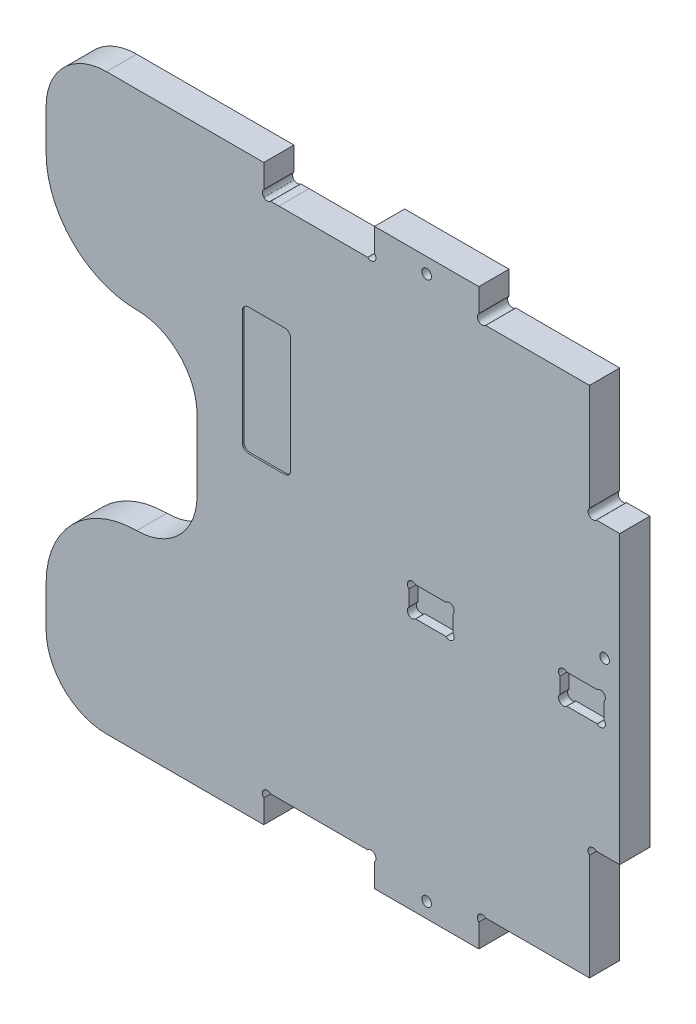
ISO-10303-21;
HEADER;
FILE_DESCRIPTION(('STEP AP214'),'2;1');
FILE_NAME('part.step','',(''),(''),'','','');
FILE_SCHEMA(('AUTOMOTIVE_DESIGN { 1 0 10303 214 1 1 1 1 }'));
ENDSEC;
DATA;
#1=APPLICATION_CONTEXT('core data for automotive mechanical design processes');
#2=APPLICATION_PROTOCOL_DEFINITION('international standard','automotive_design',2000,#1);
#3=PRODUCT_CONTEXT('',#1,'mechanical');
#4=PRODUCT('Part','Part','',(#3));
#5=PRODUCT_RELATED_PRODUCT_CATEGORY('part','',(#4));
#6=PRODUCT_DEFINITION_FORMATION('','',#4);
#7=PRODUCT_DEFINITION_CONTEXT('part definition',#1,'design');
#8=PRODUCT_DEFINITION('design','',#6,#7);
#9=PRODUCT_DEFINITION_SHAPE('','',#8);
#10=(LENGTH_UNIT() NAMED_UNIT(*) SI_UNIT(.MILLI.,.METRE.));
#11=(NAMED_UNIT(*) PLANE_ANGLE_UNIT() SI_UNIT($,.RADIAN.));
#12=(NAMED_UNIT(*) SI_UNIT($,.STERADIAN.) SOLID_ANGLE_UNIT());
#13=UNCERTAINTY_MEASURE_WITH_UNIT(LENGTH_MEASURE(1.E-05),#10,'distance_accuracy_value','');
#14=(GEOMETRIC_REPRESENTATION_CONTEXT(3) GLOBAL_UNCERTAINTY_ASSIGNED_CONTEXT((#13)) GLOBAL_UNIT_ASSIGNED_CONTEXT((#10,
#11,#12)) REPRESENTATION_CONTEXT('',''));
#15=CARTESIAN_POINT('',(0.,0.,0.));
#16=DIRECTION('',(0.,0.,1.));
#17=DIRECTION('',(1.,0.,0.));
#18=AXIS2_PLACEMENT_3D('',#15,#16,#17);
#19=CARTESIAN_POINT('',(-15.3936728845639,84.9950333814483,0.));
#20=DIRECTION('',(-0.000994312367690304,-0.999999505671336,0.));
#21=DIRECTION('',(0.999999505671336,-0.000994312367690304,0.));
#22=AXIS2_PLACEMENT_3D('',#19,#20,#21);
#23=PLANE('',#22);
#24=DIRECTION('',(-0.999999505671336,0.000994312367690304,0.));
#25=VECTOR('',#24,1.);
#26=CARTESIAN_POINT('',(-15.3936728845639,84.9950333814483,0.));
#27=LINE('',#26,#25);
#28=CARTESIAN_POINT('',(-15.3936728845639,84.9950333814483,0.));
#29=VERTEX_POINT('',#28);
#30=CARTESIAN_POINT('',(-18.1232426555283,84.9977474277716,0.));
#31=VERTEX_POINT('',#30);
#32=EDGE_CURVE('E718',#29,#31,#27,.T.);
#33=ORIENTED_EDGE('',*,*,#32,.T.);
#34=DIRECTION('',(0.,0.,1.));
#35=VECTOR('',#34,1.);
#36=CARTESIAN_POINT('',(-18.1232426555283,84.9977474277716,0.));
#37=LINE('',#36,#35);
#38=CARTESIAN_POINT('',(-18.1232426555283,84.9977474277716,10.));
#39=VERTEX_POINT('',#38);
#40=EDGE_CURVE('E669',#31,#39,#37,.T.);
#41=ORIENTED_EDGE('',*,*,#40,.T.);
#42=DIRECTION('',(-0.999999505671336,0.000994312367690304,0.));
#43=VECTOR('',#42,1.);
#44=CARTESIAN_POINT('',(-15.3936728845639,84.9950333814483,10.));
#45=LINE('',#44,#43);
#46=CARTESIAN_POINT('',(-15.3936728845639,84.9950333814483,10.));
#47=VERTEX_POINT('',#46);
#48=EDGE_CURVE('E713',#47,#39,#45,.T.);
#49=ORIENTED_EDGE('',*,*,#48,.F.);
#50=DIRECTION('',(0.,0.,1.));
#51=VECTOR('',#50,1.);
#52=CARTESIAN_POINT('',(-15.3936728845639,84.9950333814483,0.));
#53=LINE('',#52,#51);
#54=EDGE_CURVE('E705',#29,#47,#53,.T.);
#55=ORIENTED_EDGE('',*,*,#54,.F.);
#56=EDGE_LOOP('',(#33,#41,#49,#55));
#57=FACE_BOUND('',#56,.T.);
#58=ADVANCED_FACE('F35',(#57),#23,.F.);
#59=CARTESIAN_POINT('',(-20.3936704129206,85.0000049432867,0.));
#60=DIRECTION('',(1.,0.,0.));
#61=DIRECTION('',(0.,0.,-1.));
#62=AXIS2_PLACEMENT_3D('',#59,#60,#61);
#63=PLANE('',#62);
#64=DIRECTION('',(0.,0.,1.));
#65=VECTOR('',#64,1.);
#66=CARTESIAN_POINT('',(-20.3936704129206,85.0100312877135,0.));
#67=LINE('',#66,#65);
#68=CARTESIAN_POINT('',(-20.3936704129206,85.0100312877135,10.));
#69=VERTEX_POINT('',#68);
#70=CARTESIAN_POINT('',(-20.3936704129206,85.0100312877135,0.));
#71=VERTEX_POINT('',#70);
#72=EDGE_CURVE('E1033',#69,#71,#67,.F.);
#73=ORIENTED_EDGE('',*,*,#72,.F.);
#74=DIRECTION('',(0.,1.,0.));
#75=VECTOR('',#74,1.);
#76=CARTESIAN_POINT('',(-20.3936704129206,85.0000049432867,10.));
#77=LINE('',#76,#75);
#78=CARTESIAN_POINT('',(-20.3936704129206,85.0000049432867,10.));
#79=VERTEX_POINT('',#78);
#80=EDGE_CURVE('E479',#79,#69,#77,.T.);
#81=ORIENTED_EDGE('',*,*,#80,.F.);
#82=DIRECTION('',(0.,0.,1.));
#83=VECTOR('',#82,1.);
#84=CARTESIAN_POINT('',(-20.3936704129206,85.0000049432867,0.));
#85=LINE('',#84,#83);
#86=CARTESIAN_POINT('',(-20.3936704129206,85.0000049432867,0.));
#87=VERTEX_POINT('',#86);
#88=EDGE_CURVE('E698',#87,#79,#85,.T.);
#89=ORIENTED_EDGE('',*,*,#88,.F.);
#90=DIRECTION('',(0.,1.,0.));
#91=VECTOR('',#90,1.);
#92=CARTESIAN_POINT('',(-20.3936704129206,85.0000049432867,0.));
#93=LINE('',#92,#91);
#94=EDGE_CURVE('E499',#87,#71,#93,.T.);
#95=ORIENTED_EDGE('',*,*,#94,.T.);
#96=EDGE_LOOP('',(#73,#81,#89,#95));
#97=FACE_BOUND('',#96,.T.);
#98=ADVANCED_FACE('F1070',(#97),#63,.T.);
#99=DIRECTION('',(0.,0.,1.));
#100=VECTOR('',#99,1.);
#101=CARTESIAN_POINT('',(-20.3936704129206,-85.0100312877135,0.));
#102=LINE('',#101,#100);
#103=CARTESIAN_POINT('',(-20.3936704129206,-85.0100312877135,0.));
#104=VERTEX_POINT('',#103);
#105=CARTESIAN_POINT('',(-20.3936704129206,-85.0100312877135,10.));
#106=VERTEX_POINT('',#105);
#107=EDGE_CURVE('E1031',#104,#106,#102,.T.);
#108=ORIENTED_EDGE('',*,*,#107,.F.);
#109=CARTESIAN_POINT('',(-20.3936704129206,-85.0001730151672,0.));
#110=VERTEX_POINT('',#109);
#111=EDGE_CURVE('E501',#104,#110,#93,.T.);
#112=ORIENTED_EDGE('',*,*,#111,.T.);
#113=DIRECTION('',(0.,0.,-1.));
#114=VECTOR('',#113,1.);
#115=CARTESIAN_POINT('',(-20.3936704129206,-85.0001730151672,0.));
#116=LINE('',#115,#114);
#117=CARTESIAN_POINT('',(-20.3936704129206,-85.0001730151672,10.));
#118=VERTEX_POINT('',#117);
#119=EDGE_CURVE('E1029',#118,#110,#116,.T.);
#120=ORIENTED_EDGE('',*,*,#119,.F.);
#121=EDGE_CURVE('E489',#106,#118,#77,.T.);
#122=ORIENTED_EDGE('',*,*,#121,.F.);
#123=EDGE_LOOP('',(#108,#112,#120,#122));
#124=FACE_BOUND('',#123,.T.);
#125=ADVANCED_FACE('F1077',(#124),#63,.T.);
#126=CARTESIAN_POINT('',(-20.3837272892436,85.0000000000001,0.));
#127=DIRECTION('',(0.,-1.,0.));
#128=DIRECTION('',(1.,0.,0.));
#129=AXIS2_PLACEMENT_3D('',#126,#127,#128);
#130=PLANE('',#129);
#131=DIRECTION('',(0.,0.,-1.));
#132=VECTOR('',#131,1.);
#133=CARTESIAN_POINT('',(-15.3936679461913,85.0000000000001,0.));
#134=LINE('',#133,#132);
#135=CARTESIAN_POINT('',(-15.3936679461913,85.0000000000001,10.));
#136=VERTEX_POINT('',#135);
#137=CARTESIAN_POINT('',(-15.3936679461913,85.0000000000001,0.));
#138=VERTEX_POINT('',#137);
#139=EDGE_CURVE('E1022',#136,#138,#134,.T.);
#140=ORIENTED_EDGE('',*,*,#139,.F.);
#141=DIRECTION('',(1.,0.,0.));
#142=VECTOR('',#141,1.);
#143=CARTESIAN_POINT('',(-20.3837272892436,85.0000000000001,10.));
#144=LINE('',#143,#142);
#145=CARTESIAN_POINT('',(14.0162727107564,85.,10.));
#146=VERTEX_POINT('',#145);
#147=EDGE_CURVE('E818',#136,#146,#144,.T.);
#148=ORIENTED_EDGE('',*,*,#147,.T.);
#149=DIRECTION('',(0.,0.,1.));
#150=VECTOR('',#149,1.);
#151=CARTESIAN_POINT('',(14.0162727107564,85.,0.));
#152=LINE('',#151,#150);
#153=CARTESIAN_POINT('',(14.0162727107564,85.,0.));
#154=VERTEX_POINT('',#153);
#155=EDGE_CURVE('E830',#154,#146,#152,.T.);
#156=ORIENTED_EDGE('',*,*,#155,.F.);
#157=DIRECTION('',(1.,0.,0.));
#158=VECTOR('',#157,1.);
#159=CARTESIAN_POINT('',(-20.3837272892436,85.0000000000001,0.));
#160=LINE('',#159,#158);
#161=EDGE_CURVE('E821',#138,#154,#160,.T.);
#162=ORIENTED_EDGE('',*,*,#161,.F.);
#163=EDGE_LOOP('',(#140,#148,#156,#162));
#164=FACE_BOUND('',#163,.T.);
#165=ADVANCED_FACE('F1394',(#164),#130,.F.);
#166=CARTESIAN_POINT('',(-20.5726467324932,-95.0000000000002,10.));
#167=DIRECTION('',(0.,1.,0.));
#168=DIRECTION('',(-1.,0.,0.));
#169=AXIS2_PLACEMENT_3D('',#166,#167,#168);
#170=PLANE('',#169);
#171=DIRECTION('',(1.,0.,0.));
#172=VECTOR('',#171,1.);
#173=CARTESIAN_POINT('',(-20.5726467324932,-95.0000000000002,0.));
#174=LINE('',#173,#172);
#175=CARTESIAN_POINT('',(16.2790144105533,-95.0000000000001,0.));
#176=VERTEX_POINT('',#175);
#177=CARTESIAN_POINT('',(50.8372583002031,-95.0000000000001,0.));
#178=VERTEX_POINT('',#177);
#179=EDGE_CURVE('E1017',#176,#178,#174,.T.);
#180=ORIENTED_EDGE('',*,*,#179,.T.);
#181=DIRECTION('',(0.,0.,1.));
#182=VECTOR('',#181,1.);
#183=CARTESIAN_POINT('',(50.8372583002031,-95.0000000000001,0.));
#184=LINE('',#183,#182);
#185=CARTESIAN_POINT('',(50.8372583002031,-95.0000000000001,10.));
#186=VERTEX_POINT('',#185);
#187=EDGE_CURVE('E761',#178,#186,#184,.T.);
#188=ORIENTED_EDGE('',*,*,#187,.T.);
#189=DIRECTION('',(1.,0.,0.));
#190=VECTOR('',#189,1.);
#191=CARTESIAN_POINT('',(-20.5726467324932,-95.0000000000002,10.));
#192=LINE('',#191,#190);
#193=CARTESIAN_POINT('',(16.2790144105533,-95.0000000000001,10.));
#194=VERTEX_POINT('',#193);
#195=EDGE_CURVE('E1019',#194,#186,#192,.T.);
#196=ORIENTED_EDGE('',*,*,#195,.F.);
#197=DIRECTION('',(0.,0.,1.));
#198=VECTOR('',#197,1.);
#199=CARTESIAN_POINT('',(16.2790144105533,-95.0000000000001,0.));
#200=LINE('',#199,#198);
#201=EDGE_CURVE('E785',#176,#194,#200,.T.);
#202=ORIENTED_EDGE('',*,*,#201,.F.);
#203=EDGE_LOOP('',(#180,#188,#196,#202));
#204=FACE_BOUND('',#203,.T.);
#205=ADVANCED_FACE('F1421',(#204),#170,.F.);
#206=CARTESIAN_POINT('',(97.5,95.,10.));
#207=DIRECTION('',(-1.,0.,0.));
#208=DIRECTION('',(0.,-1.,0.));
#209=AXIS2_PLACEMENT_3D('',#206,#207,#208);
#210=PLANE('',#209);
#211=DIRECTION('',(0.,1.,0.));
#212=VECTOR('',#211,1.);
#213=CARTESIAN_POINT('',(97.5,95.,10.));
#214=LINE('',#213,#212);
#215=CARTESIAN_POINT('',(97.5,-47.5,10.));
#216=VERTEX_POINT('',#215);
#217=CARTESIAN_POINT('',(97.5,47.5,10.));
#218=VERTEX_POINT('',#217);
#219=EDGE_CURVE('E1014',#216,#218,#214,.T.);
#220=ORIENTED_EDGE('',*,*,#219,.F.);
#221=DIRECTION('',(0.,0.,1.));
#222=VECTOR('',#221,1.);
#223=CARTESIAN_POINT('',(97.5,-47.5,0.));
#224=LINE('',#223,#222);
#225=CARTESIAN_POINT('',(97.5,-47.5,0.));
#226=VERTEX_POINT('',#225);
#227=EDGE_CURVE('E859',#226,#216,#224,.T.);
#228=ORIENTED_EDGE('',*,*,#227,.F.);
#229=DIRECTION('',(0.,1.,0.));
#230=VECTOR('',#229,1.);
#231=CARTESIAN_POINT('',(97.5,95.,0.));
#232=LINE('',#231,#230);
#233=CARTESIAN_POINT('',(97.5,47.5,0.));
#234=VERTEX_POINT('',#233);
#235=EDGE_CURVE('E999',#226,#234,#232,.T.);
#236=ORIENTED_EDGE('',*,*,#235,.T.);
#237=DIRECTION('',(0.,0.,1.));
#238=VECTOR('',#237,1.);
#239=CARTESIAN_POINT('',(97.5,47.5,0.));
#240=LINE('',#239,#238);
#241=EDGE_CURVE('E882',#234,#218,#240,.T.);
#242=ORIENTED_EDGE('',*,*,#241,.T.);
#243=EDGE_LOOP('',(#220,#228,#236,#242));
#244=FACE_BOUND('',#243,.T.);
#245=ADVANCED_FACE('F1582',(#244),#210,.F.);
#246=CARTESIAN_POINT('',(-20.3837272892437,94.9999999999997,10.));
#247=DIRECTION('',(0.,-1.,0.));
#248=DIRECTION('',(1.,0.,0.));
#249=AXIS2_PLACEMENT_3D('',#246,#247,#248);
#250=PLANE('',#249);
#251=DIRECTION('',(-1.,0.,0.));
#252=VECTOR('',#251,1.);
#253=CARTESIAN_POINT('',(-20.3837272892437,94.9999999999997,10.));
#254=LINE('',#253,#252);
#255=CARTESIAN_POINT('',(50.8372583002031,95.0000000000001,10.));
#256=VERTEX_POINT('',#255);
#257=CARTESIAN_POINT('',(16.2790144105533,95.0000000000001,10.));
#258=VERTEX_POINT('',#257);
#259=EDGE_CURVE('E1016',#256,#258,#254,.T.);
#260=ORIENTED_EDGE('',*,*,#259,.F.);
#261=DIRECTION('',(0.,0.,1.));
#262=VECTOR('',#261,1.);
#263=CARTESIAN_POINT('',(50.8372583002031,95.0000000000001,0.));
#264=LINE('',#263,#262);
#265=CARTESIAN_POINT('',(50.8372583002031,95.0000000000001,0.));
#266=VERTEX_POINT('',#265);
#267=EDGE_CURVE('E808',#266,#256,#264,.T.);
#268=ORIENTED_EDGE('',*,*,#267,.F.);
#269=DIRECTION('',(-1.,0.,0.));
#270=VECTOR('',#269,1.);
#271=CARTESIAN_POINT('',(-20.3837272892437,94.9999999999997,0.));
#272=LINE('',#271,#270);
#273=CARTESIAN_POINT('',(16.2790144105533,94.9999999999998,0.));
#274=VERTEX_POINT('',#273);
#275=EDGE_CURVE('E1024',#266,#274,#272,.T.);
#276=ORIENTED_EDGE('',*,*,#275,.T.);
#277=DIRECTION('',(0.,0.,1.));
#278=VECTOR('',#277,1.);
#279=CARTESIAN_POINT('',(16.2790144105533,95.0000000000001,0.));
#280=LINE('',#279,#278);
#281=EDGE_CURVE('E834',#274,#258,#280,.T.);
#282=ORIENTED_EDGE('',*,*,#281,.T.);
#283=EDGE_LOOP('',(#260,#268,#276,#282));
#284=FACE_BOUND('',#283,.T.);
#285=ADVANCED_FACE('F1233',(#284),#250,.F.);
#286=CARTESIAN_POINT('',(0.,0.,10.));
#287=DIRECTION('',(0.,0.,1.));
#288=DIRECTION('',(1.,0.,0.));
#289=AXIS2_PLACEMENT_3D('',#286,#287,#288);
#290=PLANE('',#289);
#291=DIRECTION('',(0.,-1.,0.));
#292=VECTOR('',#291,1.);
#293=CARTESIAN_POINT('',(-27.5,50.9997211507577,10.));
#294=LINE('',#293,#292);
#295=CARTESIAN_POINT('',(-27.5,48.9997211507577,10.));
#296=VERTEX_POINT('',#295);
#297=CARTESIAN_POINT('',(-27.5,10.9996665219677,10.));
#298=VERTEX_POINT('',#297);
#299=EDGE_CURVE('E638',#296,#298,#294,.T.);
#300=ORIENTED_EDGE('',*,*,#299,.F.);
#301=CARTESIAN_POINT('',(-25.5,48.9997211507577,10.));
#302=DIRECTION('',(0.,0.,1.));
#303=DIRECTION('',(1.,0.,0.));
#304=AXIS2_PLACEMENT_3D('',#301,#302,#303);
#305=CIRCLE('',#304,2.);
#306=CARTESIAN_POINT('',(-25.5,50.9997211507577,10.));
#307=VERTEX_POINT('',#306);
#308=EDGE_CURVE('E625',#296,#307,#305,.F.);
#309=ORIENTED_EDGE('',*,*,#308,.T.);
#310=DIRECTION('',(-1.,0.,0.));
#311=VECTOR('',#310,1.);
#312=CARTESIAN_POINT('',(-27.5,50.9997211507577,10.));
#313=LINE('',#312,#311);
#314=CARTESIAN_POINT('',(-13.5,50.9997211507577,10.));
#315=VERTEX_POINT('',#314);
#316=EDGE_CURVE('E663',#315,#307,#313,.T.);
#317=ORIENTED_EDGE('',*,*,#316,.F.);
#318=CARTESIAN_POINT('',(-13.5,48.9997211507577,10.));
#319=DIRECTION('',(0.,0.,1.));
#320=DIRECTION('',(1.,0.,0.));
#321=AXIS2_PLACEMENT_3D('',#318,#319,#320);
#322=CIRCLE('',#321,2.);
#323=CARTESIAN_POINT('',(-11.5,48.9997211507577,10.));
#324=VERTEX_POINT('',#323);
#325=EDGE_CURVE('E11',#315,#324,#322,.F.);
#326=ORIENTED_EDGE('',*,*,#325,.T.);
#327=DIRECTION('',(0.,1.,0.));
#328=VECTOR('',#327,1.);
#329=CARTESIAN_POINT('',(-11.5,50.9997211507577,10.));
#330=LINE('',#329,#328);
#331=CARTESIAN_POINT('',(-11.5,10.9997133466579,10.));
#332=VERTEX_POINT('',#331);
#333=EDGE_CURVE('E632',#332,#324,#330,.T.);
#334=ORIENTED_EDGE('',*,*,#333,.F.);
#335=CARTESIAN_POINT('',(-13.5,10.9997133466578,10.));
#336=DIRECTION('',(0.,0.,1.));
#337=DIRECTION('',(1.,0.,0.));
#338=AXIS2_PLACEMENT_3D('',#335,#336,#337);
#339=CIRCLE('',#338,2.);
#340=CARTESIAN_POINT('',(-13.499992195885,8.99971334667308,10.));
#341=VERTEX_POINT('',#340);
#342=EDGE_CURVE('E43',#332,#341,#339,.F.);
#343=ORIENTED_EDGE('',*,*,#342,.T.);
#344=DIRECTION('',(0.999999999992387,3.90205751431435E-06,0.));
#345=VECTOR('',#344,1.);
#346=CARTESIAN_POINT('',(-27.5,8.99965871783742,10.));
#347=LINE('',#346,#345);
#348=CARTESIAN_POINT('',(-25.499992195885,8.9996665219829,10.));
#349=VERTEX_POINT('',#348);
#350=EDGE_CURVE('E631',#349,#341,#347,.T.);
#351=ORIENTED_EDGE('',*,*,#350,.F.);
#352=CARTESIAN_POINT('',(-25.5,10.9996665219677,10.));
#353=DIRECTION('',(0.,0.,1.));
#354=DIRECTION('',(1.,0.,0.));
#355=AXIS2_PLACEMENT_3D('',#352,#353,#354);
#356=CIRCLE('',#355,2.);
#357=EDGE_CURVE('E627',#349,#298,#356,.F.);
#358=ORIENTED_EDGE('',*,*,#357,.T.);
#359=EDGE_LOOP('',(#300,#309,#317,#326,#334,#343,#351,#358));
#360=FACE_BOUND('',#359,.T.);
#361=DIRECTION('',(0.,-1.,0.));
#362=VECTOR('',#361,1.);
#363=CARTESIAN_POINT('',(-92.5,-85.0001829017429,10.));
#364=LINE('',#363,#362);
#365=CARTESIAN_POINT('',(-92.5,-61.6666666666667,10.));
#366=VERTEX_POINT('',#365);
#367=CARTESIAN_POINT('',(-92.5,-75.0000000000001,10.));
#368=VERTEX_POINT('',#367);
#369=EDGE_CURVE('E491',#366,#368,#364,.T.);
#370=ORIENTED_EDGE('',*,*,#369,.T.);
#371=CARTESIAN_POINT('',(-72.5,-75.0000000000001,10.));
#372=DIRECTION('',(0.,0.,1.));
#373=DIRECTION('',(1.,0.,0.));
#374=AXIS2_PLACEMENT_3D('',#371,#372,#373);
#375=CIRCLE('',#374,20.);
#376=CARTESIAN_POINT('',(-72.5,-95.0000000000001,10.));
#377=VERTEX_POINT('',#376);
#378=EDGE_CURVE('E538',#368,#377,#375,.T.);
#379=ORIENTED_EDGE('',*,*,#378,.T.);
#380=DIRECTION('',(1.,0.,0.));
#381=VECTOR('',#380,1.);
#382=CARTESIAN_POINT('',(-92.5,-95.0000000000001,10.));
#383=LINE('',#382,#381);
#384=CARTESIAN_POINT('',(-20.3936704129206,-95.0000000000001,10.));
#385=VERTEX_POINT('',#384);
#386=EDGE_CURVE('E487',#377,#385,#383,.T.);
#387=ORIENTED_EDGE('',*,*,#386,.T.);
#388=CARTESIAN_POINT('',(-20.3936704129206,-87.2527104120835,10.));
#389=VERTEX_POINT('',#388);
#390=EDGE_CURVE('E490',#385,#389,#77,.T.);
#391=ORIENTED_EDGE('',*,*,#390,.T.);
#392=CARTESIAN_POINT('',(-19.2523564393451,-86.1313708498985,10.));
#393=DIRECTION('',(0.,0.,1.));
#394=DIRECTION('',(1.,0.,0.));
#395=AXIS2_PLACEMENT_3D('',#392,#393,#394);
#396=CIRCLE('',#395,1.6);
#397=EDGE_CURVE('E672',#106,#389,#396,.T.);
#398=ORIENTED_EDGE('',*,*,#397,.F.);
#399=ORIENTED_EDGE('',*,*,#121,.T.);
#400=DIRECTION('',(-0.999999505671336,0.000994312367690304,0.));
#401=VECTOR('',#400,1.);
#402=CARTESIAN_POINT('',(-15.5627060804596,-85.0049765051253,10.));
#403=LINE('',#402,#401);
#404=CARTESIAN_POINT('',(-20.3839099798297,-85.0001827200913,10.));
#405=VERTEX_POINT('',#404);
#406=EDGE_CURVE('E688',#405,#118,#403,.T.);
#407=ORIENTED_EDGE('',*,*,#406,.F.);
#408=CARTESIAN_POINT('',(-18.1209855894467,-85.,10.));
#409=VERTEX_POINT('',#408);
#410=EDGE_CURVE('E677',#409,#405,#396,.T.);
#411=ORIENTED_EDGE('',*,*,#410,.F.);
#412=DIRECTION('',(-1.,0.,0.));
#413=VECTOR('',#412,1.);
#414=CARTESIAN_POINT('',(-20.3837272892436,-85.0000000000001,10.));
#415=LINE('',#414,#413);
#416=CARTESIAN_POINT('',(14.0162727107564,-85.,10.));
#417=VERTEX_POINT('',#416);
#418=EDGE_CURVE('E778',#417,#409,#415,.T.);
#419=ORIENTED_EDGE('',*,*,#418,.F.);
#420=CARTESIAN_POINT('',(15.1476435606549,-86.1313708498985,10.));
#421=DIRECTION('',(0.,0.,1.));
#422=DIRECTION('',(-1.,0.,0.));
#423=AXIS2_PLACEMENT_3D('',#420,#421,#422);
#424=CIRCLE('',#423,1.60000000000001);
#425=CARTESIAN_POINT('',(16.2790144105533,-87.262741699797,10.));
#426=VERTEX_POINT('',#425);
#427=EDGE_CURVE('E758',#426,#417,#424,.T.);
#428=ORIENTED_EDGE('',*,*,#427,.F.);
#429=DIRECTION('',(0.,1.,0.));
#430=VECTOR('',#429,1.);
#431=CARTESIAN_POINT('',(16.2790144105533,-95.0000000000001,10.));
#432=LINE('',#431,#430);
#433=EDGE_CURVE('E769',#194,#426,#432,.T.);
#434=ORIENTED_EDGE('',*,*,#433,.F.);
#435=ORIENTED_EDGE('',*,*,#195,.T.);
#436=DIRECTION('',(0.,-1.,0.));
#437=VECTOR('',#436,1.);
#438=CARTESIAN_POINT('',(50.8372583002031,-95.0000000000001,10.));
#439=LINE('',#438,#437);
#440=CARTESIAN_POINT('',(50.8372583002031,-87.262741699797,10.));
#441=VERTEX_POINT('',#440);
#442=EDGE_CURVE('E752',#441,#186,#439,.T.);
#443=ORIENTED_EDGE('',*,*,#442,.F.);
#444=CARTESIAN_POINT('',(51.9686291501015,-86.1313708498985,10.));
#445=DIRECTION('',(0.,0.,1.));
#446=DIRECTION('',(1.,0.,0.));
#447=AXIS2_PLACEMENT_3D('',#444,#445,#446);
#448=CIRCLE('',#447,1.60000000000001);
#449=CARTESIAN_POINT('',(53.1,-85.,10.));
#450=VERTEX_POINT('',#449);
#451=EDGE_CURVE('E736',#450,#441,#448,.T.);
#452=ORIENTED_EDGE('',*,*,#451,.F.);
#453=DIRECTION('',(-1.,0.,0.));
#454=VECTOR('',#453,1.);
#455=CARTESIAN_POINT('',(87.5,-85.0000000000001,10.));
#456=LINE('',#455,#454);
#457=CARTESIAN_POINT('',(87.5,-85.0000000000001,10.));
#458=VERTEX_POINT('',#457);
#459=EDGE_CURVE('E743',#458,#450,#456,.T.);
#460=ORIENTED_EDGE('',*,*,#459,.F.);
#461=DIRECTION('',(0.,-1.,0.));
#462=VECTOR('',#461,1.);
#463=CARTESIAN_POINT('',(87.5,-95.,10.));
#464=LINE('',#463,#462);
#465=CARTESIAN_POINT('',(87.5000000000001,-49.762741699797,10.));
#466=VERTEX_POINT('',#465);
#467=EDGE_CURVE('E851',#466,#458,#464,.T.);
#468=ORIENTED_EDGE('',*,*,#467,.F.);
#469=CARTESIAN_POINT('',(88.6313708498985,-48.6313708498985,10.));
#470=DIRECTION('',(0.,0.,1.));
#471=DIRECTION('',(1.,0.,0.));
#472=AXIS2_PLACEMENT_3D('',#469,#470,#471);
#473=CIRCLE('',#472,1.6);
#474=CARTESIAN_POINT('',(89.762741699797,-47.5,10.));
#475=VERTEX_POINT('',#474);
#476=EDGE_CURVE('E833',#475,#466,#473,.T.);
#477=ORIENTED_EDGE('',*,*,#476,.F.);
#478=DIRECTION('',(-1.,0.,0.));
#479=VECTOR('',#478,1.);
#480=CARTESIAN_POINT('',(97.5,-47.5,10.));
#481=LINE('',#480,#479);
#482=EDGE_CURVE('E842',#216,#475,#481,.T.);
#483=ORIENTED_EDGE('',*,*,#482,.F.);
#484=ORIENTED_EDGE('',*,*,#219,.T.);
#485=DIRECTION('',(1.,0.,0.));
#486=VECTOR('',#485,1.);
#487=CARTESIAN_POINT('',(97.5,47.5,10.));
#488=LINE('',#487,#486);
#489=CARTESIAN_POINT('',(89.762741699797,47.5,10.));
#490=VERTEX_POINT('',#489);
#491=EDGE_CURVE('E874',#490,#218,#488,.T.);
#492=ORIENTED_EDGE('',*,*,#491,.F.);
#493=CARTESIAN_POINT('',(88.6313708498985,48.6313708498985,10.));
#494=DIRECTION('',(0.,0.,1.));
#495=DIRECTION('',(-1.,0.,0.));
#496=AXIS2_PLACEMENT_3D('',#493,#494,#495);
#497=CIRCLE('',#496,1.6);
#498=CARTESIAN_POINT('',(87.5000000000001,49.762741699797,10.));
#499=VERTEX_POINT('',#498);
#500=EDGE_CURVE('E858',#499,#490,#497,.T.);
#501=ORIENTED_EDGE('',*,*,#500,.F.);
#502=DIRECTION('',(0.,-1.,0.));
#503=VECTOR('',#502,1.);
#504=CARTESIAN_POINT('',(87.5,95.,10.));
#505=LINE('',#504,#503);
#506=CARTESIAN_POINT('',(87.5,85.,10.));
#507=VERTEX_POINT('',#506);
#508=EDGE_CURVE('E866',#507,#499,#505,.T.);
#509=ORIENTED_EDGE('',*,*,#508,.F.);
#510=DIRECTION('',(1.,0.,0.));
#511=VECTOR('',#510,1.);
#512=CARTESIAN_POINT('',(87.5,85.0000000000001,10.));
#513=LINE('',#512,#511);
#514=CARTESIAN_POINT('',(53.1,85.,10.));
#515=VERTEX_POINT('',#514);
#516=EDGE_CURVE('E801',#515,#507,#513,.T.);
#517=ORIENTED_EDGE('',*,*,#516,.F.);
#518=CARTESIAN_POINT('',(51.9686291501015,86.1313708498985,10.));
#519=DIRECTION('',(0.,0.,1.));
#520=DIRECTION('',(-1.,0.,0.));
#521=AXIS2_PLACEMENT_3D('',#518,#519,#520);
#522=CIRCLE('',#521,1.60000000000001);
#523=CARTESIAN_POINT('',(50.8372583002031,87.262741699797,10.));
#524=VERTEX_POINT('',#523);
#525=EDGE_CURVE('E784',#524,#515,#522,.T.);
#526=ORIENTED_EDGE('',*,*,#525,.F.);
#527=DIRECTION('',(0.,-1.,0.));
#528=VECTOR('',#527,1.);
#529=CARTESIAN_POINT('',(50.8372583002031,95.0000000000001,10.));
#530=LINE('',#529,#528);
#531=EDGE_CURVE('E792',#256,#524,#530,.T.);
#532=ORIENTED_EDGE('',*,*,#531,.F.);
#533=ORIENTED_EDGE('',*,*,#259,.T.);
#534=DIRECTION('',(0.,1.,0.));
#535=VECTOR('',#534,1.);
#536=CARTESIAN_POINT('',(16.2790144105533,95.0000000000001,10.));
#537=LINE('',#536,#535);
#538=CARTESIAN_POINT('',(16.2790144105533,87.262741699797,10.));
#539=VERTEX_POINT('',#538);
#540=EDGE_CURVE('E826',#539,#258,#537,.T.);
#541=ORIENTED_EDGE('',*,*,#540,.F.);
#542=CARTESIAN_POINT('',(15.1476435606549,86.1313708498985,10.));
#543=DIRECTION('',(0.,0.,1.));
#544=DIRECTION('',(1.,0.,0.));
#545=AXIS2_PLACEMENT_3D('',#542,#543,#544);
#546=CIRCLE('',#545,1.60000000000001);
#547=EDGE_CURVE('E807',#146,#539,#546,.T.);
#548=ORIENTED_EDGE('',*,*,#547,.F.);
#549=ORIENTED_EDGE('',*,*,#147,.F.);
#550=DIRECTION('',(0.000994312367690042,0.999999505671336,0.));
#551=VECTOR('',#550,1.);
#552=CARTESIAN_POINT('',(-15.383729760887,94.9950284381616,10.));
#553=LINE('',#552,#551);
#554=EDGE_CURVE('E708',#47,#136,#553,.T.);
#555=ORIENTED_EDGE('',*,*,#554,.F.);
#556=ORIENTED_EDGE('',*,*,#48,.T.);
#557=CARTESIAN_POINT('',(-19.2523564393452,86.1313708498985,10.));
#558=DIRECTION('',(0.,0.,1.));
#559=DIRECTION('',(-1.,0.,0.));
#560=AXIS2_PLACEMENT_3D('',#557,#558,#559);
#561=CIRCLE('',#560,1.6);
#562=CARTESIAN_POINT('',(-20.3837223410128,84.9999950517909,10.));
#563=VERTEX_POINT('',#562);
#564=EDGE_CURVE('E481',#563,#39,#561,.T.);
#565=ORIENTED_EDGE('',*,*,#564,.F.);
#566=EDGE_CURVE('E717',#563,#79,#45,.T.);
#567=ORIENTED_EDGE('',*,*,#566,.T.);
#568=ORIENTED_EDGE('',*,*,#80,.T.);
#569=CARTESIAN_POINT('',(-20.3936704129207,87.2527104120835,10.));
#570=VERTEX_POINT('',#569);
#571=EDGE_CURVE('E461',#570,#69,#561,.T.);
#572=ORIENTED_EDGE('',*,*,#571,.F.);
#573=CARTESIAN_POINT('',(-20.3936704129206,95.0000000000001,10.));
#574=VERTEX_POINT('',#573);
#575=EDGE_CURVE('E476',#570,#574,#77,.T.);
#576=ORIENTED_EDGE('',*,*,#575,.T.);
#577=DIRECTION('',(-1.,0.,0.));
#578=VECTOR('',#577,1.);
#579=CARTESIAN_POINT('',(-20.3936704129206,95.0000000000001,10.));
#580=LINE('',#579,#578);
#581=CARTESIAN_POINT('',(-72.5,95.0000000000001,10.));
#582=VERTEX_POINT('',#581);
#583=EDGE_CURVE('E529',#574,#582,#580,.T.);
#584=ORIENTED_EDGE('',*,*,#583,.T.);
#585=CARTESIAN_POINT('',(-72.5,75.0000000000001,10.));
#586=DIRECTION('',(0.,0.,1.));
#587=DIRECTION('',(1.,0.,0.));
#588=AXIS2_PLACEMENT_3D('',#585,#586,#587);
#589=CIRCLE('',#588,20.);
#590=CARTESIAN_POINT('',(-92.5,75.0000000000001,10.));
#591=VERTEX_POINT('',#590);
#592=EDGE_CURVE('E577',#582,#591,#589,.T.);
#593=ORIENTED_EDGE('',*,*,#592,.T.);
#594=DIRECTION('',(0.,-1.,0.));
#595=VECTOR('',#594,1.);
#596=CARTESIAN_POINT('',(-92.5,85.0000049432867,10.));
#597=LINE('',#596,#595);
#598=CARTESIAN_POINT('',(-92.5,61.6666666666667,10.));
#599=VERTEX_POINT('',#598);
#600=EDGE_CURVE('E531',#591,#599,#597,.T.);
#601=ORIENTED_EDGE('',*,*,#600,.T.);
#602=CARTESIAN_POINT('',(-62.5,61.6666666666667,10.));
#603=DIRECTION('',(0.,0.,1.));
#604=DIRECTION('',(1.,0.,0.));
#605=AXIS2_PLACEMENT_3D('',#602,#603,#604);
#606=CIRCLE('',#605,30.);
#607=CARTESIAN_POINT('',(-62.5,31.6666666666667,10.));
#608=VERTEX_POINT('',#607);
#609=EDGE_CURVE('E560',#599,#608,#606,.T.);
#610=ORIENTED_EDGE('',*,*,#609,.T.);
#611=CARTESIAN_POINT('',(-62.5,11.6666666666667,10.));
#612=DIRECTION('',(0.,0.,1.));
#613=DIRECTION('',(1.,0.,0.));
#614=AXIS2_PLACEMENT_3D('',#611,#612,#613);
#615=CIRCLE('',#614,20.);
#616=CARTESIAN_POINT('',(-42.5,11.6666666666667,10.));
#617=VERTEX_POINT('',#616);
#618=EDGE_CURVE('E594',#608,#617,#615,.F.);
#619=ORIENTED_EDGE('',*,*,#618,.T.);
#620=DIRECTION('',(0.,-1.,0.));
#621=VECTOR('',#620,1.);
#622=CARTESIAN_POINT('',(-42.5,31.6666666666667,10.));
#623=LINE('',#622,#621);
#624=CARTESIAN_POINT('',(-42.5,-11.6666666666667,10.));
#625=VERTEX_POINT('',#624);
#626=EDGE_CURVE('E534',#617,#625,#623,.T.);
#627=ORIENTED_EDGE('',*,*,#626,.T.);
#628=CARTESIAN_POINT('',(-62.5,-11.6666666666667,10.));
#629=DIRECTION('',(0.,0.,1.));
#630=DIRECTION('',(1.,0.,0.));
#631=AXIS2_PLACEMENT_3D('',#628,#629,#630);
#632=CIRCLE('',#631,20.);
#633=CARTESIAN_POINT('',(-62.5,-31.6666666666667,10.));
#634=VERTEX_POINT('',#633);
#635=EDGE_CURVE('E590',#625,#634,#632,.F.);
#636=ORIENTED_EDGE('',*,*,#635,.T.);
#637=CARTESIAN_POINT('',(-62.5,-61.6666666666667,10.));
#638=DIRECTION('',(0.,0.,1.));
#639=DIRECTION('',(1.,0.,0.));
#640=AXIS2_PLACEMENT_3D('',#637,#638,#639);
#641=CIRCLE('',#640,30.);
#642=EDGE_CURVE('E541',#634,#366,#641,.T.);
#643=ORIENTED_EDGE('',*,*,#642,.T.);
#644=EDGE_LOOP('',(#370,#379,#387,#391,#398,#399,#407,#411,#419,#428,#434,#435,#443,#452,#460,
#468,#477,#483,#484,#492,#501,#509,#517,#526,#532,#533,#541,#548,#549,#555,#556,#565,#567,#568,
#572,#576,#584,#593,#601,#610,#619,#627,#636,#643));
#645=FACE_BOUND('',#644,.T.);
#646=CARTESIAN_POINT('',(92.5,9.2032176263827,10.));
#647=DIRECTION('',(0.,0.,1.));
#648=DIRECTION('',(1.,0.,0.));
#649=AXIS2_PLACEMENT_3D('',#646,#647,#648);
#650=CIRCLE('',#649,1.6);
#651=CARTESIAN_POINT('',(94.1,9.2032176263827,10.));
#652=VERTEX_POINT('',#651);
#653=EDGE_CURVE('E716',#652,#652,#650,.T.);
#654=ORIENTED_EDGE('',*,*,#653,.F.);
#655=EDGE_LOOP('',(#654));
#656=FACE_BOUND('',#655,.T.);
#657=CARTESIAN_POINT('',(33.5581363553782,-90.0000000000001,10.));
#658=DIRECTION('',(0.,0.,1.));
#659=DIRECTION('',(1.,0.,0.));
#660=AXIS2_PLACEMENT_3D('',#657,#658,#659);
#661=CIRCLE('',#660,1.6);
#662=CARTESIAN_POINT('',(35.1581363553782,-90.0000000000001,10.));
#663=VERTEX_POINT('',#662);
#664=EDGE_CURVE('E724',#663,#663,#661,.T.);
#665=ORIENTED_EDGE('',*,*,#664,.F.);
#666=EDGE_LOOP('',(#665));
#667=FACE_BOUND('',#666,.T.);
#668=CARTESIAN_POINT('',(33.5581363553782,90.0000000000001,10.));
#669=DIRECTION('',(0.,0.,1.));
#670=DIRECTION('',(1.,0.,0.));
#671=AXIS2_PLACEMENT_3D('',#668,#669,#670);
#672=CIRCLE('',#671,1.6);
#673=CARTESIAN_POINT('',(35.1581363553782,90.0000000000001,10.));
#674=VERTEX_POINT('',#673);
#675=EDGE_CURVE('E730',#674,#674,#672,.T.);
#676=ORIENTED_EDGE('',*,*,#675,.F.);
#677=EDGE_LOOP('',(#676));
#678=FACE_BOUND('',#677,.T.);
#679=CARTESIAN_POINT('',(28.7556235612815,-2.13149261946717,10.));
#680=DIRECTION('',(0.,0.,1.));
#681=DIRECTION('',(1.,0.,0.));
#682=AXIS2_PLACEMENT_3D('',#679,#680,#681);
#683=CIRCLE('',#682,1.60000000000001);
#684=CARTESIAN_POINT('',(29.8869899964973,-1.00011735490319,10.));
#685=VERTEX_POINT('',#684);
#686=CARTESIAN_POINT('',(27.6242571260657,-3.26286788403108,10.));
#687=VERTEX_POINT('',#686);
#688=EDGE_CURVE('E881',#685,#687,#683,.T.);
#689=ORIENTED_EDGE('',*,*,#688,.F.);
#690=DIRECTION('',(-0.999999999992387,-3.90205751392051E-06,0.));
#691=VECTOR('',#690,1.);
#692=CARTESIAN_POINT('',(39.9515065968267,-1.00007808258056,10.));
#693=LINE('',#692,#691);
#694=CARTESIAN_POINT('',(39.9515065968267,-1.00007808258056,10.));
#695=VERTEX_POINT('',#694);
#696=EDGE_CURVE('E890',#695,#685,#693,.T.);
#697=ORIENTED_EDGE('',*,*,#696,.F.);
#698=CARTESIAN_POINT('',(41.0828818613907,-2.1314445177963,10.));
#699=DIRECTION('',(0.,0.,1.));
#700=DIRECTION('',(-1.,0.,0.));
#701=AXIS2_PLACEMENT_3D('',#698,#699,#700);
#702=CIRCLE('',#701,1.60000000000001);
#703=CARTESIAN_POINT('',(42.2142571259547,-3.26281095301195,10.));
#704=VERTEX_POINT('',#703);
#705=EDGE_CURVE('E928',#704,#695,#702,.T.);
#706=ORIENTED_EDGE('',*,*,#705,.F.);
#707=DIRECTION('',(-3.90205751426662E-06,0.999999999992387,0.));
#708=VECTOR('',#707,1.);
#709=CARTESIAN_POINT('',(42.2142571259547,-3.26281095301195,10.));
#710=LINE('',#709,#708);
#711=CARTESIAN_POINT('',(42.2142777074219,-8.53732755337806,10.));
#712=VERTEX_POINT('',#711);
#713=EDGE_CURVE('E925',#712,#704,#710,.T.);
#714=ORIENTED_EDGE('',*,*,#713,.F.);
#715=CARTESIAN_POINT('',(41.082911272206,-9.66870281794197,10.));
#716=DIRECTION('',(0.,0.,1.));
#717=DIRECTION('',(1.,0.,0.));
#718=AXIS2_PLACEMENT_3D('',#715,#716,#717);
#719=CIRCLE('',#718,1.60000000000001);
#720=CARTESIAN_POINT('',(39.9515448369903,-10.800078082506,10.));
#721=VERTEX_POINT('',#720);
#722=EDGE_CURVE('E922',#721,#712,#719,.T.);
#723=ORIENTED_EDGE('',*,*,#722,.F.);
#724=DIRECTION('',(0.999999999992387,3.90205751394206E-06,0.));
#725=VECTOR('',#724,1.);
#726=CARTESIAN_POINT('',(39.9515448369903,-10.800078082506,10.));
#727=LINE('',#726,#725);
#728=CARTESIAN_POINT('',(29.8870282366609,-10.8001173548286,10.));
#729=VERTEX_POINT('',#728);
#730=EDGE_CURVE('E919',#729,#721,#727,.T.);
#731=ORIENTED_EDGE('',*,*,#730,.F.);
#732=CARTESIAN_POINT('',(28.7556529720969,-9.66875091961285,10.));
#733=DIRECTION('',(0.,0.,1.));
#734=DIRECTION('',(-1.,0.,0.));
#735=AXIS2_PLACEMENT_3D('',#732,#733,#734);
#736=CIRCLE('',#735,1.60000000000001);
#737=CARTESIAN_POINT('',(27.6242777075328,-8.53738448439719,10.));
#738=VERTEX_POINT('',#737);
#739=EDGE_CURVE('E916',#738,#729,#736,.T.);
#740=ORIENTED_EDGE('',*,*,#739,.F.);
#741=DIRECTION('',(3.90205751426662E-06,-0.999999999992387,0.));
#742=VECTOR('',#741,1.);
#743=CARTESIAN_POINT('',(27.6242571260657,-3.26286788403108,10.));
#744=LINE('',#743,#742);
#745=EDGE_CURVE('E913',#687,#738,#744,.T.);
#746=ORIENTED_EDGE('',*,*,#745,.F.);
#747=EDGE_LOOP('',(#689,#697,#706,#714,#723,#731,#740,#746));
#748=FACE_BOUND('',#747,.T.);
#749=CARTESIAN_POINT('',(78.8413708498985,-2.13137084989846,10.));
#750=DIRECTION('',(0.,0.,1.));
#751=DIRECTION('',(1.,0.,0.));
#752=AXIS2_PLACEMENT_3D('',#749,#750,#751);
#753=CIRCLE('',#752,1.60000000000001);
#754=CARTESIAN_POINT('',(79.972741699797,-0.999999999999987,10.));
#755=VERTEX_POINT('',#754);
#756=CARTESIAN_POINT('',(77.7099999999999,-3.26274169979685,10.));
#757=VERTEX_POINT('',#756);
#758=EDGE_CURVE('E935',#755,#757,#753,.T.);
#759=ORIENTED_EDGE('',*,*,#758,.F.);
#760=DIRECTION('',(-1.,0.,0.));
#761=VECTOR('',#760,1.);
#762=CARTESIAN_POINT('',(79.972741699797,-0.999999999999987,10.));
#763=LINE('',#762,#761);
#764=CARTESIAN_POINT('',(90.037258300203,-0.999999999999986,10.));
#765=VERTEX_POINT('',#764);
#766=EDGE_CURVE('E954',#765,#755,#763,.T.);
#767=ORIENTED_EDGE('',*,*,#766,.F.);
#768=CARTESIAN_POINT('',(91.1686291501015,-2.13137084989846,10.));
#769=DIRECTION('',(0.,0.,1.));
#770=DIRECTION('',(-1.,0.,0.));
#771=AXIS2_PLACEMENT_3D('',#768,#769,#770);
#772=CIRCLE('',#771,1.60000000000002);
#773=CARTESIAN_POINT('',(92.3000000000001,-3.26274169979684,10.));
#774=VERTEX_POINT('',#773);
#775=EDGE_CURVE('E992',#774,#765,#772,.T.);
#776=ORIENTED_EDGE('',*,*,#775,.F.);
#777=DIRECTION('',(0.,1.,0.));
#778=VECTOR('',#777,1.);
#779=CARTESIAN_POINT('',(92.3000000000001,-3.26274169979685,10.));
#780=LINE('',#779,#778);
#781=CARTESIAN_POINT('',(92.3,-8.53725830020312,10.));
#782=VERTEX_POINT('',#781);
#783=EDGE_CURVE('E989',#782,#774,#780,.T.);
#784=ORIENTED_EDGE('',*,*,#783,.F.);
#785=CARTESIAN_POINT('',(91.1686291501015,-9.66862915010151,10.));
#786=DIRECTION('',(0.,0.,1.));
#787=DIRECTION('',(1.,0.,0.));
#788=AXIS2_PLACEMENT_3D('',#785,#786,#787);
#789=CIRCLE('',#788,1.6);
#790=CARTESIAN_POINT('',(90.037258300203,-10.8,10.));
#791=VERTEX_POINT('',#790);
#792=EDGE_CURVE('E986',#791,#782,#789,.T.);
#793=ORIENTED_EDGE('',*,*,#792,.F.);
#794=DIRECTION('',(1.,0.,0.));
#795=VECTOR('',#794,1.);
#796=CARTESIAN_POINT('',(79.972741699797,-10.8,10.));
#797=LINE('',#796,#795);
#798=CARTESIAN_POINT('',(79.972741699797,-10.8,10.));
#799=VERTEX_POINT('',#798);
#800=EDGE_CURVE('E983',#799,#791,#797,.T.);
#801=ORIENTED_EDGE('',*,*,#800,.F.);
#802=CARTESIAN_POINT('',(78.8413708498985,-9.66862915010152,10.));
#803=DIRECTION('',(0.,0.,1.));
#804=DIRECTION('',(-1.,0.,0.));
#805=AXIS2_PLACEMENT_3D('',#802,#803,#804);
#806=CIRCLE('',#805,1.60000000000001);
#807=CARTESIAN_POINT('',(77.7099999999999,-8.53725830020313,10.));
#808=VERTEX_POINT('',#807);
#809=EDGE_CURVE('E980',#808,#799,#806,.T.);
#810=ORIENTED_EDGE('',*,*,#809,.F.);
#811=DIRECTION('',(0.,-1.,0.));
#812=VECTOR('',#811,1.);
#813=CARTESIAN_POINT('',(77.7099999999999,-3.26274169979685,10.));
#814=LINE('',#813,#812);
#815=EDGE_CURVE('E977',#757,#808,#814,.T.);
#816=ORIENTED_EDGE('',*,*,#815,.F.);
#817=EDGE_LOOP('',(#759,#767,#776,#784,#793,#801,#810,#816));
#818=FACE_BOUND('',#817,.T.);
#819=ADVANCED_FACE('F473',(#360,#645,#656,#667,#678,#748,#818),#290,.T.);
#820=CARTESIAN_POINT('',(0.,0.,0.));
#821=DIRECTION('',(0.,0.,1.));
#822=DIRECTION('',(1.,0.,0.));
#823=AXIS2_PLACEMENT_3D('',#820,#821,#822);
#824=PLANE('',#823);
#825=CARTESIAN_POINT('',(92.5,9.2032176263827,0.));
#826=DIRECTION('',(0.,0.,1.));
#827=DIRECTION('',(1.,0.,0.));
#828=AXIS2_PLACEMENT_3D('',#825,#826,#827);
#829=CIRCLE('',#828,1.6);
#830=CARTESIAN_POINT('',(94.1,9.2032176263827,0.));
#831=VERTEX_POINT('',#830);
#832=EDGE_CURVE('E721',#831,#831,#829,.T.);
#833=ORIENTED_EDGE('',*,*,#832,.T.);
#834=EDGE_LOOP('',(#833));
#835=FACE_BOUND('',#834,.T.);
#836=CARTESIAN_POINT('',(33.5581363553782,-90.0000000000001,0.));
#837=DIRECTION('',(0.,0.,1.));
#838=DIRECTION('',(1.,0.,0.));
#839=AXIS2_PLACEMENT_3D('',#836,#837,#838);
#840=CIRCLE('',#839,1.6);
#841=CARTESIAN_POINT('',(35.1581363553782,-90.0000000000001,0.));
#842=VERTEX_POINT('',#841);
#843=EDGE_CURVE('E727',#842,#842,#840,.T.);
#844=ORIENTED_EDGE('',*,*,#843,.T.);
#845=EDGE_LOOP('',(#844));
#846=FACE_BOUND('',#845,.T.);
#847=CARTESIAN_POINT('',(33.5581363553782,90.0000000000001,0.));
#848=DIRECTION('',(0.,0.,1.));
#849=DIRECTION('',(1.,0.,0.));
#850=AXIS2_PLACEMENT_3D('',#847,#848,#849);
#851=CIRCLE('',#850,1.6);
#852=CARTESIAN_POINT('',(35.1581363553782,90.0000000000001,0.));
#853=VERTEX_POINT('',#852);
#854=EDGE_CURVE('E733',#853,#853,#851,.T.);
#855=ORIENTED_EDGE('',*,*,#854,.T.);
#856=EDGE_LOOP('',(#855));
#857=FACE_BOUND('',#856,.T.);
#858=DIRECTION('',(1.,0.,0.));
#859=VECTOR('',#858,1.);
#860=CARTESIAN_POINT('',(-92.5,-95.0000000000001,0.));
#861=LINE('',#860,#859);
#862=CARTESIAN_POINT('',(-72.5,-95.0000000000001,0.));
#863=VERTEX_POINT('',#862);
#864=CARTESIAN_POINT('',(-20.3936704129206,-95.0000000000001,0.));
#865=VERTEX_POINT('',#864);
#866=EDGE_CURVE('E527',#863,#865,#861,.T.);
#867=ORIENTED_EDGE('',*,*,#866,.F.);
#868=CARTESIAN_POINT('',(-72.5,-75.0000000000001,0.));
#869=DIRECTION('',(0.,0.,1.));
#870=DIRECTION('',(1.,0.,0.));
#871=AXIS2_PLACEMENT_3D('',#868,#869,#870);
#872=CIRCLE('',#871,20.);
#873=CARTESIAN_POINT('',(-92.5,-75.0000000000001,0.));
#874=VERTEX_POINT('',#873);
#875=EDGE_CURVE('E584',#863,#874,#872,.F.);
#876=ORIENTED_EDGE('',*,*,#875,.T.);
#877=DIRECTION('',(0.,-1.,0.));
#878=VECTOR('',#877,1.);
#879=CARTESIAN_POINT('',(-92.5,-31.6666666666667,0.));
#880=LINE('',#879,#878);
#881=CARTESIAN_POINT('',(-92.5,-61.6666666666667,0.));
#882=VERTEX_POINT('',#881);
#883=EDGE_CURVE('E524',#882,#874,#880,.T.);
#884=ORIENTED_EDGE('',*,*,#883,.F.);
#885=CARTESIAN_POINT('',(-62.5,-61.6666666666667,0.));
#886=DIRECTION('',(0.,0.,1.));
#887=DIRECTION('',(1.,0.,0.));
#888=AXIS2_PLACEMENT_3D('',#885,#886,#887);
#889=CIRCLE('',#888,30.);
#890=CARTESIAN_POINT('',(-62.5,-31.6666666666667,0.));
#891=VERTEX_POINT('',#890);
#892=EDGE_CURVE('E555',#882,#891,#889,.F.);
#893=ORIENTED_EDGE('',*,*,#892,.T.);
#894=CARTESIAN_POINT('',(-62.5,-11.6666666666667,0.));
#895=DIRECTION('',(0.,0.,1.));
#896=DIRECTION('',(1.,0.,0.));
#897=AXIS2_PLACEMENT_3D('',#894,#895,#896);
#898=CIRCLE('',#897,20.);
#899=CARTESIAN_POINT('',(-42.5,-11.6666666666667,0.));
#900=VERTEX_POINT('',#899);
#901=EDGE_CURVE('E592',#891,#900,#898,.T.);
#902=ORIENTED_EDGE('',*,*,#901,.T.);
#903=DIRECTION('',(0.,-1.,0.));
#904=VECTOR('',#903,1.);
#905=CARTESIAN_POINT('',(-42.5,31.6666666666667,0.));
#906=LINE('',#905,#904);
#907=CARTESIAN_POINT('',(-42.5,11.6666666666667,0.));
#908=VERTEX_POINT('',#907);
#909=EDGE_CURVE('E519',#908,#900,#906,.T.);
#910=ORIENTED_EDGE('',*,*,#909,.F.);
#911=CARTESIAN_POINT('',(-62.5,11.6666666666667,0.));
#912=DIRECTION('',(0.,0.,1.));
#913=DIRECTION('',(1.,0.,0.));
#914=AXIS2_PLACEMENT_3D('',#911,#912,#913);
#915=CIRCLE('',#914,20.);
#916=CARTESIAN_POINT('',(-62.5,31.6666666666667,0.));
#917=VERTEX_POINT('',#916);
#918=EDGE_CURVE('E596',#908,#917,#915,.T.);
#919=ORIENTED_EDGE('',*,*,#918,.T.);
#920=CARTESIAN_POINT('',(-62.5,61.6666666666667,0.));
#921=DIRECTION('',(0.,0.,1.));
#922=DIRECTION('',(1.,0.,0.));
#923=AXIS2_PLACEMENT_3D('',#920,#921,#922);
#924=CIRCLE('',#923,30.);
#925=CARTESIAN_POINT('',(-92.5,61.6666666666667,0.));
#926=VERTEX_POINT('',#925);
#927=EDGE_CURVE('E556',#917,#926,#924,.F.);
#928=ORIENTED_EDGE('',*,*,#927,.T.);
#929=DIRECTION('',(0.,-1.,0.));
#930=VECTOR('',#929,1.);
#931=CARTESIAN_POINT('',(-92.5,95.0000000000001,0.));
#932=LINE('',#931,#930);
#933=CARTESIAN_POINT('',(-92.5,75.0000000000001,0.));
#934=VERTEX_POINT('',#933);
#935=EDGE_CURVE('E514',#934,#926,#932,.T.);
#936=ORIENTED_EDGE('',*,*,#935,.F.);
#937=CARTESIAN_POINT('',(-72.5,75.0000000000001,0.));
#938=DIRECTION('',(0.,0.,1.));
#939=DIRECTION('',(1.,0.,0.));
#940=AXIS2_PLACEMENT_3D('',#937,#938,#939);
#941=CIRCLE('',#940,20.);
#942=CARTESIAN_POINT('',(-72.5,95.0000000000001,0.));
#943=VERTEX_POINT('',#942);
#944=EDGE_CURVE('E582',#934,#943,#941,.F.);
#945=ORIENTED_EDGE('',*,*,#944,.T.);
#946=DIRECTION('',(-1.,0.,0.));
#947=VECTOR('',#946,1.);
#948=CARTESIAN_POINT('',(-20.3936704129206,95.0000000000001,0.));
#949=LINE('',#948,#947);
#950=CARTESIAN_POINT('',(-20.3936704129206,95.0000000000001,0.));
#951=VERTEX_POINT('',#950);
#952=EDGE_CURVE('E508',#951,#943,#949,.T.);
#953=ORIENTED_EDGE('',*,*,#952,.F.);
#954=CARTESIAN_POINT('',(-20.3936704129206,87.2527104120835,0.));
#955=VERTEX_POINT('',#954);
#956=EDGE_CURVE('E496',#955,#951,#93,.T.);
#957=ORIENTED_EDGE('',*,*,#956,.F.);
#958=CARTESIAN_POINT('',(-19.2523564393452,86.1313708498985,0.));
#959=DIRECTION('',(0.,0.,1.));
#960=DIRECTION('',(-1.,0.,0.));
#961=AXIS2_PLACEMENT_3D('',#958,#959,#960);
#962=CIRCLE('',#961,1.6);
#963=EDGE_CURVE('E464',#955,#71,#962,.T.);
#964=ORIENTED_EDGE('',*,*,#963,.T.);
#965=ORIENTED_EDGE('',*,*,#94,.F.);
#966=CARTESIAN_POINT('',(-20.3837223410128,84.9999950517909,0.));
#967=VERTEX_POINT('',#966);
#968=EDGE_CURVE('E710',#967,#87,#27,.T.);
#969=ORIENTED_EDGE('',*,*,#968,.F.);
#970=EDGE_CURVE('E480',#967,#31,#962,.T.);
#971=ORIENTED_EDGE('',*,*,#970,.T.);
#972=ORIENTED_EDGE('',*,*,#32,.F.);
#973=DIRECTION('',(-0.000994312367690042,-0.999999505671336,0.));
#974=VECTOR('',#973,1.);
#975=CARTESIAN_POINT('',(-15.383729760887,94.9950284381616,0.));
#976=LINE('',#975,#974);
#977=EDGE_CURVE('E703',#138,#29,#976,.T.);
#978=ORIENTED_EDGE('',*,*,#977,.F.);
#979=ORIENTED_EDGE('',*,*,#161,.T.);
#980=CARTESIAN_POINT('',(15.1476435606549,86.1313708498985,0.));
#981=DIRECTION('',(0.,0.,1.));
#982=DIRECTION('',(1.,0.,0.));
#983=AXIS2_PLACEMENT_3D('',#980,#981,#982);
#984=CIRCLE('',#983,1.60000000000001);
#985=CARTESIAN_POINT('',(16.2790144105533,87.262741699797,0.));
#986=VERTEX_POINT('',#985);
#987=EDGE_CURVE('E814',#154,#986,#984,.T.);
#988=ORIENTED_EDGE('',*,*,#987,.T.);
#989=DIRECTION('',(0.,1.,0.));
#990=VECTOR('',#989,1.);
#991=CARTESIAN_POINT('',(16.2790144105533,95.0000000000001,0.));
#992=LINE('',#991,#990);
#993=EDGE_CURVE('E817',#986,#274,#992,.T.);
#994=ORIENTED_EDGE('',*,*,#993,.T.);
#995=ORIENTED_EDGE('',*,*,#275,.F.);
#996=DIRECTION('',(0.,-1.,0.));
#997=VECTOR('',#996,1.);
#998=CARTESIAN_POINT('',(50.8372583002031,95.0000000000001,0.));
#999=LINE('',#998,#997);
#1000=CARTESIAN_POINT('',(50.8372583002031,87.262741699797,0.));
#1001=VERTEX_POINT('',#1000);
#1002=EDGE_CURVE('E795',#266,#1001,#999,.T.);
#1003=ORIENTED_EDGE('',*,*,#1002,.T.);
#1004=CARTESIAN_POINT('',(51.9686291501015,86.1313708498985,0.));
#1005=DIRECTION('',(0.,0.,1.));
#1006=DIRECTION('',(-1.,0.,0.));
#1007=AXIS2_PLACEMENT_3D('',#1004,#1005,#1006);
#1008=CIRCLE('',#1007,1.60000000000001);
#1009=CARTESIAN_POINT('',(53.1,85.,0.));
#1010=VERTEX_POINT('',#1009);
#1011=EDGE_CURVE('E788',#1001,#1010,#1008,.T.);
#1012=ORIENTED_EDGE('',*,*,#1011,.T.);
#1013=DIRECTION('',(1.,0.,0.));
#1014=VECTOR('',#1013,1.);
#1015=CARTESIAN_POINT('',(87.5,85.0000000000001,0.));
#1016=LINE('',#1015,#1014);
#1017=CARTESIAN_POINT('',(87.5,85.0000000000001,0.));
#1018=VERTEX_POINT('',#1017);
#1019=EDGE_CURVE('E791',#1010,#1018,#1016,.T.);
#1020=ORIENTED_EDGE('',*,*,#1019,.T.);
#1021=DIRECTION('',(0.,-1.,0.));
#1022=VECTOR('',#1021,1.);
#1023=CARTESIAN_POINT('',(87.5,95.,0.));
#1024=LINE('',#1023,#1022);
#1025=CARTESIAN_POINT('',(87.5000000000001,49.762741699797,0.));
#1026=VERTEX_POINT('',#1025);
#1027=EDGE_CURVE('E869',#1018,#1026,#1024,.T.);
#1028=ORIENTED_EDGE('',*,*,#1027,.T.);
#1029=CARTESIAN_POINT('',(88.6313708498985,48.6313708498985,0.));
#1030=DIRECTION('',(0.,0.,1.));
#1031=DIRECTION('',(-1.,0.,0.));
#1032=AXIS2_PLACEMENT_3D('',#1029,#1030,#1031);
#1033=CIRCLE('',#1032,1.6);
#1034=CARTESIAN_POINT('',(89.762741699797,47.5,0.));
#1035=VERTEX_POINT('',#1034);
#1036=EDGE_CURVE('E862',#1026,#1035,#1033,.T.);
#1037=ORIENTED_EDGE('',*,*,#1036,.T.);
#1038=DIRECTION('',(1.,0.,0.));
#1039=VECTOR('',#1038,1.);
#1040=CARTESIAN_POINT('',(97.5,47.5,0.));
#1041=LINE('',#1040,#1039);
#1042=EDGE_CURVE('E865',#1035,#234,#1041,.T.);
#1043=ORIENTED_EDGE('',*,*,#1042,.T.);
#1044=ORIENTED_EDGE('',*,*,#235,.F.);
#1045=DIRECTION('',(-1.,0.,0.));
#1046=VECTOR('',#1045,1.);
#1047=CARTESIAN_POINT('',(97.5,-47.5,0.));
#1048=LINE('',#1047,#1046);
#1049=CARTESIAN_POINT('',(89.762741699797,-47.5,0.));
#1050=VERTEX_POINT('',#1049);
#1051=EDGE_CURVE('E845',#226,#1050,#1048,.T.);
#1052=ORIENTED_EDGE('',*,*,#1051,.T.);
#1053=CARTESIAN_POINT('',(88.6313708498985,-48.6313708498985,0.));
#1054=DIRECTION('',(0.,0.,1.));
#1055=DIRECTION('',(1.,0.,0.));
#1056=AXIS2_PLACEMENT_3D('',#1053,#1054,#1055);
#1057=CIRCLE('',#1056,1.6);
#1058=CARTESIAN_POINT('',(87.5000000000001,-49.762741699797,0.));
#1059=VERTEX_POINT('',#1058);
#1060=EDGE_CURVE('E838',#1050,#1059,#1057,.T.);
#1061=ORIENTED_EDGE('',*,*,#1060,.T.);
#1062=DIRECTION('',(0.,-1.,0.));
#1063=VECTOR('',#1062,1.);
#1064=CARTESIAN_POINT('',(87.5,-95.,0.));
#1065=LINE('',#1064,#1063);
#1066=CARTESIAN_POINT('',(87.5,-85.,0.));
#1067=VERTEX_POINT('',#1066);
#1068=EDGE_CURVE('E841',#1059,#1067,#1065,.T.);
#1069=ORIENTED_EDGE('',*,*,#1068,.T.);
#1070=DIRECTION('',(-1.,0.,0.));
#1071=VECTOR('',#1070,1.);
#1072=CARTESIAN_POINT('',(87.5,-85.0000000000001,0.));
#1073=LINE('',#1072,#1071);
#1074=CARTESIAN_POINT('',(53.1,-85.,0.));
#1075=VERTEX_POINT('',#1074);
#1076=EDGE_CURVE('E746',#1067,#1075,#1073,.T.);
#1077=ORIENTED_EDGE('',*,*,#1076,.T.);
#1078=CARTESIAN_POINT('',(51.9686291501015,-86.1313708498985,0.));
#1079=DIRECTION('',(0.,0.,1.));
#1080=DIRECTION('',(1.,0.,0.));
#1081=AXIS2_PLACEMENT_3D('',#1078,#1079,#1080);
#1082=CIRCLE('',#1081,1.60000000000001);
#1083=CARTESIAN_POINT('',(50.8372583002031,-87.262741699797,0.));
#1084=VERTEX_POINT('',#1083);
#1085=EDGE_CURVE('E739',#1075,#1084,#1082,.T.);
#1086=ORIENTED_EDGE('',*,*,#1085,.T.);
#1087=DIRECTION('',(0.,-1.,0.));
#1088=VECTOR('',#1087,1.);
#1089=CARTESIAN_POINT('',(50.8372583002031,-95.0000000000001,0.));
#1090=LINE('',#1089,#1088);
#1091=EDGE_CURVE('E742',#1084,#178,#1090,.T.);
#1092=ORIENTED_EDGE('',*,*,#1091,.T.);
#1093=ORIENTED_EDGE('',*,*,#179,.F.);
#1094=DIRECTION('',(0.,1.,0.));
#1095=VECTOR('',#1094,1.);
#1096=CARTESIAN_POINT('',(16.2790144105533,-95.0000000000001,0.));
#1097=LINE('',#1096,#1095);
#1098=CARTESIAN_POINT('',(16.2790144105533,-87.262741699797,0.));
#1099=VERTEX_POINT('',#1098);
#1100=EDGE_CURVE('E772',#176,#1099,#1097,.T.);
#1101=ORIENTED_EDGE('',*,*,#1100,.T.);
#1102=CARTESIAN_POINT('',(15.1476435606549,-86.1313708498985,0.));
#1103=DIRECTION('',(0.,0.,1.));
#1104=DIRECTION('',(-1.,0.,0.));
#1105=AXIS2_PLACEMENT_3D('',#1102,#1103,#1104);
#1106=CIRCLE('',#1105,1.60000000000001);
#1107=CARTESIAN_POINT('',(14.0162727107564,-85.,0.));
#1108=VERTEX_POINT('',#1107);
#1109=EDGE_CURVE('E765',#1099,#1108,#1106,.T.);
#1110=ORIENTED_EDGE('',*,*,#1109,.T.);
#1111=DIRECTION('',(-1.,0.,0.));
#1112=VECTOR('',#1111,1.);
#1113=CARTESIAN_POINT('',(-20.3837272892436,-85.0000000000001,0.));
#1114=LINE('',#1113,#1112);
#1115=CARTESIAN_POINT('',(-18.1209855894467,-85.,0.));
#1116=VERTEX_POINT('',#1115);
#1117=EDGE_CURVE('E768',#1108,#1116,#1114,.T.);
#1118=ORIENTED_EDGE('',*,*,#1117,.T.);
#1119=CARTESIAN_POINT('',(-19.2523564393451,-86.1313708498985,0.));
#1120=DIRECTION('',(0.,0.,1.));
#1121=DIRECTION('',(1.,0.,0.));
#1122=AXIS2_PLACEMENT_3D('',#1119,#1120,#1121);
#1123=CIRCLE('',#1122,1.6);
#1124=CARTESIAN_POINT('',(-20.3839099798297,-85.0001827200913,0.));
#1125=VERTEX_POINT('',#1124);
#1126=EDGE_CURVE('E673',#1116,#1125,#1123,.T.);
#1127=ORIENTED_EDGE('',*,*,#1126,.T.);
#1128=DIRECTION('',(-0.999999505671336,0.000994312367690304,0.));
#1129=VECTOR('',#1128,1.);
#1130=CARTESIAN_POINT('',(-15.5627060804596,-85.0049765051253,0.));
#1131=LINE('',#1130,#1129);
#1132=EDGE_CURVE('E689',#1125,#110,#1131,.T.);
#1133=ORIENTED_EDGE('',*,*,#1132,.T.);
#1134=ORIENTED_EDGE('',*,*,#111,.F.);
#1135=CARTESIAN_POINT('',(-20.3936704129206,-87.2527104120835,0.));
#1136=VERTEX_POINT('',#1135);
#1137=EDGE_CURVE('E676',#104,#1136,#1123,.T.);
#1138=ORIENTED_EDGE('',*,*,#1137,.T.);
#1139=EDGE_CURVE('E502',#865,#1136,#93,.T.);
#1140=ORIENTED_EDGE('',*,*,#1139,.F.);
#1141=EDGE_LOOP('',(#867,#876,#884,#893,#902,#910,#919,#928,#936,#945,#953,#957,#964,#965,#969,
#971,#972,#978,#979,#988,#994,#995,#1003,#1012,#1020,#1028,#1037,#1043,#1044,#1052,#1061,#1069,
#1077,#1086,#1092,#1093,#1101,#1110,#1118,#1127,#1133,#1134,#1138,#1140));
#1142=FACE_BOUND('',#1141,.T.);
#1143=ADVANCED_FACE('F1055',(#835,#846,#857,#1142),#824,.F.);
#1144=CARTESIAN_POINT('',(78.8413708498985,-2.13137084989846,7.));
#1145=DIRECTION('',(0.,0.,1.));
#1146=DIRECTION('',(1.,0.,0.));
#1147=AXIS2_PLACEMENT_3D('',#1144,#1145,#1146);
#1148=CYLINDRICAL_SURFACE('',#1147,1.60000000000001);
#1149=ORIENTED_EDGE('',*,*,#758,.T.);
#1150=DIRECTION('',(0.,0.,1.));
#1151=VECTOR('',#1150,1.);
#1152=CARTESIAN_POINT('',(77.7099999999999,-3.26274169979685,7.));
#1153=LINE('',#1152,#1151);
#1154=CARTESIAN_POINT('',(77.7099999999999,-3.26274169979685,7.));
#1155=VERTEX_POINT('',#1154);
#1156=EDGE_CURVE('E975',#1155,#757,#1153,.T.);
#1157=ORIENTED_EDGE('',*,*,#1156,.F.);
#1158=CARTESIAN_POINT('',(78.8413708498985,-2.13137084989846,7.));
#1159=DIRECTION('',(0.,0.,1.));
#1160=DIRECTION('',(1.,0.,0.));
#1161=AXIS2_PLACEMENT_3D('',#1158,#1159,#1160);
#1162=CIRCLE('',#1161,1.60000000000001);
#1163=CARTESIAN_POINT('',(79.972741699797,-0.999999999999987,7.));
#1164=VERTEX_POINT('',#1163);
#1165=EDGE_CURVE('E950',#1164,#1155,#1162,.T.);
#1166=ORIENTED_EDGE('',*,*,#1165,.F.);
#1167=DIRECTION('',(0.,0.,1.));
#1168=VECTOR('',#1167,1.);
#1169=CARTESIAN_POINT('',(79.972741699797,-0.999999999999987,7.));
#1170=LINE('',#1169,#1168);
#1171=EDGE_CURVE('E997',#1164,#755,#1170,.T.);
#1172=ORIENTED_EDGE('',*,*,#1171,.T.);
#1173=EDGE_LOOP('',(#1149,#1157,#1166,#1172));
#1174=FACE_BOUND('',#1173,.T.);
#1175=ADVANCED_FACE('F1316',(#1174),#1148,.F.);
#1176=CARTESIAN_POINT('',(79.972741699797,-0.999999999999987,7.));
#1177=DIRECTION('',(0.,1.,0.));
#1178=DIRECTION('',(-1.,0.,0.));
#1179=AXIS2_PLACEMENT_3D('',#1176,#1177,#1178);
#1180=PLANE('',#1179);
#1181=ORIENTED_EDGE('',*,*,#766,.T.);
#1182=ORIENTED_EDGE('',*,*,#1171,.F.);
#1183=DIRECTION('',(-1.,0.,0.));
#1184=VECTOR('',#1183,1.);
#1185=CARTESIAN_POINT('',(79.972741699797,-0.999999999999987,7.));
#1186=LINE('',#1185,#1184);
#1187=CARTESIAN_POINT('',(90.037258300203,-0.999999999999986,7.));
#1188=VERTEX_POINT('',#1187);
#1189=EDGE_CURVE('E972',#1188,#1164,#1186,.T.);
#1190=ORIENTED_EDGE('',*,*,#1189,.F.);
#1191=DIRECTION('',(0.,0.,1.));
#1192=VECTOR('',#1191,1.);
#1193=CARTESIAN_POINT('',(90.037258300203,-0.999999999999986,7.));
#1194=LINE('',#1193,#1192);
#1195=EDGE_CURVE('E1000',#1188,#765,#1194,.T.);
#1196=ORIENTED_EDGE('',*,*,#1195,.T.);
#1197=EDGE_LOOP('',(#1181,#1182,#1190,#1196));
#1198=FACE_BOUND('',#1197,.T.);
#1199=ADVANCED_FACE('F1792',(#1198),#1180,.F.);
#1200=CARTESIAN_POINT('',(91.1686291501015,-2.13137084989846,7.));
#1201=DIRECTION('',(0.,0.,1.));
#1202=DIRECTION('',(1.,0.,0.));
#1203=AXIS2_PLACEMENT_3D('',#1200,#1201,#1202);
#1204=CYLINDRICAL_SURFACE('',#1203,1.60000000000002);
#1205=ORIENTED_EDGE('',*,*,#775,.T.);
#1206=ORIENTED_EDGE('',*,*,#1195,.F.);
#1207=CARTESIAN_POINT('',(91.1686291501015,-2.13137084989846,7.));
#1208=DIRECTION('',(0.,0.,1.));
#1209=DIRECTION('',(-1.,0.,0.));
#1210=AXIS2_PLACEMENT_3D('',#1207,#1208,#1209);
#1211=CIRCLE('',#1210,1.60000000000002);
#1212=CARTESIAN_POINT('',(92.3000000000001,-3.26274169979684,7.));
#1213=VERTEX_POINT('',#1212);
#1214=EDGE_CURVE('E969',#1213,#1188,#1211,.T.);
#1215=ORIENTED_EDGE('',*,*,#1214,.F.);
#1216=DIRECTION('',(0.,0.,1.));
#1217=VECTOR('',#1216,1.);
#1218=CARTESIAN_POINT('',(92.3000000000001,-3.26274169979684,7.));
#1219=LINE('',#1218,#1217);
#1220=EDGE_CURVE('E1002',#1213,#774,#1219,.T.);
#1221=ORIENTED_EDGE('',*,*,#1220,.T.);
#1222=EDGE_LOOP('',(#1205,#1206,#1215,#1221));
#1223=FACE_BOUND('',#1222,.T.);
#1224=ADVANCED_FACE('F1782',(#1223),#1204,.F.);
#1225=CARTESIAN_POINT('',(92.3000000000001,-3.26274169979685,7.));
#1226=DIRECTION('',(1.,0.,0.));
#1227=DIRECTION('',(0.,1.,0.));
#1228=AXIS2_PLACEMENT_3D('',#1225,#1226,#1227);
#1229=PLANE('',#1228);
#1230=ORIENTED_EDGE('',*,*,#783,.T.);
#1231=ORIENTED_EDGE('',*,*,#1220,.F.);
#1232=DIRECTION('',(0.,1.,0.));
#1233=VECTOR('',#1232,1.);
#1234=CARTESIAN_POINT('',(92.3000000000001,-3.26274169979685,7.));
#1235=LINE('',#1234,#1233);
#1236=CARTESIAN_POINT('',(92.3,-8.53725830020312,7.));
#1237=VERTEX_POINT('',#1236);
#1238=EDGE_CURVE('E966',#1237,#1213,#1235,.T.);
#1239=ORIENTED_EDGE('',*,*,#1238,.F.);
#1240=DIRECTION('',(0.,0.,1.));
#1241=VECTOR('',#1240,1.);
#1242=CARTESIAN_POINT('',(92.3,-8.53725830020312,7.));
#1243=LINE('',#1242,#1241);
#1244=EDGE_CURVE('E1004',#1237,#782,#1243,.T.);
#1245=ORIENTED_EDGE('',*,*,#1244,.T.);
#1246=EDGE_LOOP('',(#1230,#1231,#1239,#1245));
#1247=FACE_BOUND('',#1246,.T.);
#1248=ADVANCED_FACE('F1772',(#1247),#1229,.F.);
#1249=CARTESIAN_POINT('',(91.1686291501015,-9.66862915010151,7.));
#1250=DIRECTION('',(0.,0.,1.));
#1251=DIRECTION('',(1.,0.,0.));
#1252=AXIS2_PLACEMENT_3D('',#1249,#1250,#1251);
#1253=CYLINDRICAL_SURFACE('',#1252,1.6);
#1254=ORIENTED_EDGE('',*,*,#792,.T.);
#1255=ORIENTED_EDGE('',*,*,#1244,.F.);
#1256=CARTESIAN_POINT('',(91.1686291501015,-9.66862915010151,7.));
#1257=DIRECTION('',(0.,0.,1.));
#1258=DIRECTION('',(1.,0.,0.));
#1259=AXIS2_PLACEMENT_3D('',#1256,#1257,#1258);
#1260=CIRCLE('',#1259,1.6);
#1261=CARTESIAN_POINT('',(90.037258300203,-10.8,7.));
#1262=VERTEX_POINT('',#1261);
#1263=EDGE_CURVE('E963',#1262,#1237,#1260,.T.);
#1264=ORIENTED_EDGE('',*,*,#1263,.F.);
#1265=DIRECTION('',(0.,0.,1.));
#1266=VECTOR('',#1265,1.);
#1267=CARTESIAN_POINT('',(90.037258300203,-10.8,7.));
#1268=LINE('',#1267,#1266);
#1269=EDGE_CURVE('E1006',#1262,#791,#1268,.T.);
#1270=ORIENTED_EDGE('',*,*,#1269,.T.);
#1271=EDGE_LOOP('',(#1254,#1255,#1264,#1270));
#1272=FACE_BOUND('',#1271,.T.);
#1273=ADVANCED_FACE('F1762',(#1272),#1253,.F.);
#1274=CARTESIAN_POINT('',(79.972741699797,-10.8,7.));
#1275=DIRECTION('',(0.,-1.,0.));
#1276=DIRECTION('',(1.,0.,0.));
#1277=AXIS2_PLACEMENT_3D('',#1274,#1275,#1276);
#1278=PLANE('',#1277);
#1279=ORIENTED_EDGE('',*,*,#800,.T.);
#1280=ORIENTED_EDGE('',*,*,#1269,.F.);
#1281=DIRECTION('',(1.,0.,0.));
#1282=VECTOR('',#1281,1.);
#1283=CARTESIAN_POINT('',(79.972741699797,-10.8,7.));
#1284=LINE('',#1283,#1282);
#1285=CARTESIAN_POINT('',(79.972741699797,-10.8,7.));
#1286=VERTEX_POINT('',#1285);
#1287=EDGE_CURVE('E960',#1286,#1262,#1284,.T.);
#1288=ORIENTED_EDGE('',*,*,#1287,.F.);
#1289=DIRECTION('',(0.,0.,1.));
#1290=VECTOR('',#1289,1.);
#1291=CARTESIAN_POINT('',(79.972741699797,-10.8,7.));
#1292=LINE('',#1291,#1290);
#1293=EDGE_CURVE('E1008',#1286,#799,#1292,.T.);
#1294=ORIENTED_EDGE('',*,*,#1293,.T.);
#1295=EDGE_LOOP('',(#1279,#1280,#1288,#1294));
#1296=FACE_BOUND('',#1295,.T.);
#1297=ADVANCED_FACE('F1752',(#1296),#1278,.F.);
#1298=CARTESIAN_POINT('',(78.8413708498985,-9.66862915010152,7.));
#1299=DIRECTION('',(0.,0.,1.));
#1300=DIRECTION('',(1.,0.,0.));
#1301=AXIS2_PLACEMENT_3D('',#1298,#1299,#1300);
#1302=CYLINDRICAL_SURFACE('',#1301,1.60000000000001);
#1303=ORIENTED_EDGE('',*,*,#809,.T.);
#1304=ORIENTED_EDGE('',*,*,#1293,.F.);
#1305=CARTESIAN_POINT('',(78.8413708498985,-9.66862915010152,7.));
#1306=DIRECTION('',(0.,0.,1.));
#1307=DIRECTION('',(-1.,0.,0.));
#1308=AXIS2_PLACEMENT_3D('',#1305,#1306,#1307);
#1309=CIRCLE('',#1308,1.60000000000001);
#1310=CARTESIAN_POINT('',(77.7099999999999,-8.53725830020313,7.));
#1311=VERTEX_POINT('',#1310);
#1312=EDGE_CURVE('E957',#1311,#1286,#1309,.T.);
#1313=ORIENTED_EDGE('',*,*,#1312,.F.);
#1314=DIRECTION('',(0.,0.,1.));
#1315=VECTOR('',#1314,1.);
#1316=CARTESIAN_POINT('',(77.7099999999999,-8.53725830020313,7.));
#1317=LINE('',#1316,#1315);
#1318=EDGE_CURVE('E1010',#1311,#808,#1317,.T.);
#1319=ORIENTED_EDGE('',*,*,#1318,.T.);
#1320=EDGE_LOOP('',(#1303,#1304,#1313,#1319));
#1321=FACE_BOUND('',#1320,.T.);
#1322=ADVANCED_FACE('F1742',(#1321),#1302,.F.);
#1323=CARTESIAN_POINT('',(77.7099999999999,-3.26274169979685,7.));
#1324=DIRECTION('',(-1.,0.,0.));
#1325=DIRECTION('',(0.,0.,1.));
#1326=AXIS2_PLACEMENT_3D('',#1323,#1324,#1325);
#1327=PLANE('',#1326);
#1328=ORIENTED_EDGE('',*,*,#815,.T.);
#1329=ORIENTED_EDGE('',*,*,#1318,.F.);
#1330=DIRECTION('',(0.,-1.,0.));
#1331=VECTOR('',#1330,1.);
#1332=CARTESIAN_POINT('',(77.7099999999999,-3.26274169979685,7.));
#1333=LINE('',#1332,#1331);
#1334=EDGE_CURVE('E953',#1155,#1311,#1333,.T.);
#1335=ORIENTED_EDGE('',*,*,#1334,.F.);
#1336=ORIENTED_EDGE('',*,*,#1156,.T.);
#1337=EDGE_LOOP('',(#1328,#1329,#1335,#1336));
#1338=FACE_BOUND('',#1337,.T.);
#1339=ADVANCED_FACE('F1731',(#1338),#1327,.F.);
#1340=CARTESIAN_POINT('',(78.8413708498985,-2.13137084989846,7.));
#1341=DIRECTION('',(0.,0.,1.));
#1342=DIRECTION('',(1.,0.,0.));
#1343=AXIS2_PLACEMENT_3D('',#1340,#1341,#1342);
#1344=PLANE('',#1343);
#1345=ORIENTED_EDGE('',*,*,#1165,.T.);
#1346=ORIENTED_EDGE('',*,*,#1334,.T.);
#1347=ORIENTED_EDGE('',*,*,#1312,.T.);
#1348=ORIENTED_EDGE('',*,*,#1287,.T.);
#1349=ORIENTED_EDGE('',*,*,#1263,.T.);
#1350=ORIENTED_EDGE('',*,*,#1238,.T.);
#1351=ORIENTED_EDGE('',*,*,#1214,.T.);
#1352=ORIENTED_EDGE('',*,*,#1189,.T.);
#1353=EDGE_LOOP('',(#1345,#1346,#1347,#1348,#1349,#1350,#1351,#1352));
#1354=FACE_BOUND('',#1353,.T.);
#1355=ADVANCED_FACE('F1721',(#1354),#1344,.T.);
#1356=CARTESIAN_POINT('',(28.7556235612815,-2.13149261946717,7.));
#1357=DIRECTION('',(0.,0.,1.));
#1358=DIRECTION('',(1.,0.,0.));
#1359=AXIS2_PLACEMENT_3D('',#1356,#1357,#1358);
#1360=CYLINDRICAL_SURFACE('',#1359,1.60000000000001);
#1361=ORIENTED_EDGE('',*,*,#688,.T.);
#1362=DIRECTION('',(0.,0.,1.));
#1363=VECTOR('',#1362,1.);
#1364=CARTESIAN_POINT('',(27.6242571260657,-3.26286788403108,7.));
#1365=LINE('',#1364,#1363);
#1366=CARTESIAN_POINT('',(27.6242571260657,-3.26286788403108,7.));
#1367=VERTEX_POINT('',#1366);
#1368=EDGE_CURVE('E911',#1367,#687,#1365,.T.);
#1369=ORIENTED_EDGE('',*,*,#1368,.F.);
#1370=CARTESIAN_POINT('',(28.7556235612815,-2.13149261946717,7.));
#1371=DIRECTION('',(0.,0.,1.));
#1372=DIRECTION('',(1.,0.,0.));
#1373=AXIS2_PLACEMENT_3D('',#1370,#1371,#1372);
#1374=CIRCLE('',#1373,1.60000000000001);
#1375=CARTESIAN_POINT('',(29.8869899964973,-1.00011735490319,7.));
#1376=VERTEX_POINT('',#1375);
#1377=EDGE_CURVE('E886',#1376,#1367,#1374,.T.);
#1378=ORIENTED_EDGE('',*,*,#1377,.F.);
#1379=DIRECTION('',(0.,0.,1.));
#1380=VECTOR('',#1379,1.);
#1381=CARTESIAN_POINT('',(29.8869899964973,-1.00011735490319,7.));
#1382=LINE('',#1381,#1380);
#1383=EDGE_CURVE('E933',#1376,#685,#1382,.T.);
#1384=ORIENTED_EDGE('',*,*,#1383,.T.);
#1385=EDGE_LOOP('',(#1361,#1369,#1378,#1384));
#1386=FACE_BOUND('',#1385,.T.);
#1387=ADVANCED_FACE('F1711',(#1386),#1360,.F.);
#1388=CARTESIAN_POINT('',(39.9515065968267,-1.00007808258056,7.));
#1389=DIRECTION('',(-3.90205751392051E-06,0.999999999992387,0.));
#1390=DIRECTION('',(-0.999999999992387,-3.90205751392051E-06,0.));
#1391=AXIS2_PLACEMENT_3D('',#1388,#1389,#1390);
#1392=PLANE('',#1391);
#1393=ORIENTED_EDGE('',*,*,#696,.T.);
#1394=ORIENTED_EDGE('',*,*,#1383,.F.);
#1395=DIRECTION('',(-0.999999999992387,-3.90205751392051E-06,0.));
#1396=VECTOR('',#1395,1.);
#1397=CARTESIAN_POINT('',(39.9515065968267,-1.00007808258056,7.));
#1398=LINE('',#1397,#1396);
#1399=CARTESIAN_POINT('',(39.9515065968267,-1.00007808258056,7.));
#1400=VERTEX_POINT('',#1399);
#1401=EDGE_CURVE('E908',#1400,#1376,#1398,.T.);
#1402=ORIENTED_EDGE('',*,*,#1401,.F.);
#1403=DIRECTION('',(0.,0.,1.));
#1404=VECTOR('',#1403,1.);
#1405=CARTESIAN_POINT('',(39.9515065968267,-1.00007808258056,7.));
#1406=LINE('',#1405,#1404);
#1407=EDGE_CURVE('E936',#1400,#695,#1406,.T.);
#1408=ORIENTED_EDGE('',*,*,#1407,.T.);
#1409=EDGE_LOOP('',(#1393,#1394,#1402,#1408));
#1410=FACE_BOUND('',#1409,.T.);
#1411=ADVANCED_FACE('F1701',(#1410),#1392,.F.);
#1412=CARTESIAN_POINT('',(41.0828818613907,-2.1314445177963,7.));
#1413=DIRECTION('',(0.,0.,1.));
#1414=DIRECTION('',(1.,0.,0.));
#1415=AXIS2_PLACEMENT_3D('',#1412,#1413,#1414);
#1416=CYLINDRICAL_SURFACE('',#1415,1.60000000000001);
#1417=ORIENTED_EDGE('',*,*,#705,.T.);
#1418=ORIENTED_EDGE('',*,*,#1407,.F.);
#1419=CARTESIAN_POINT('',(41.0828818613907,-2.1314445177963,7.));
#1420=DIRECTION('',(0.,0.,1.));
#1421=DIRECTION('',(-1.,0.,0.));
#1422=AXIS2_PLACEMENT_3D('',#1419,#1420,#1421);
#1423=CIRCLE('',#1422,1.60000000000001);
#1424=CARTESIAN_POINT('',(42.2142571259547,-3.26281095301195,7.));
#1425=VERTEX_POINT('',#1424);
#1426=EDGE_CURVE('E905',#1425,#1400,#1423,.T.);
#1427=ORIENTED_EDGE('',*,*,#1426,.F.);
#1428=DIRECTION('',(0.,0.,1.));
#1429=VECTOR('',#1428,1.);
#1430=CARTESIAN_POINT('',(42.2142571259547,-3.26281095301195,7.));
#1431=LINE('',#1430,#1429);
#1432=EDGE_CURVE('E938',#1425,#704,#1431,.T.);
#1433=ORIENTED_EDGE('',*,*,#1432,.T.);
#1434=EDGE_LOOP('',(#1417,#1418,#1427,#1433));
#1435=FACE_BOUND('',#1434,.T.);
#1436=ADVANCED_FACE('F1691',(#1435),#1416,.F.);
#1437=CARTESIAN_POINT('',(42.2142571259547,-3.26281095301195,7.));
#1438=DIRECTION('',(0.999999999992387,3.90205751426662E-06,0.));
#1439=DIRECTION('',(-3.90205751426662E-06,0.999999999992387,0.));
#1440=AXIS2_PLACEMENT_3D('',#1437,#1438,#1439);
#1441=PLANE('',#1440);
#1442=ORIENTED_EDGE('',*,*,#713,.T.);
#1443=ORIENTED_EDGE('',*,*,#1432,.F.);
#1444=DIRECTION('',(-3.90205751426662E-06,0.999999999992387,0.));
#1445=VECTOR('',#1444,1.);
#1446=CARTESIAN_POINT('',(42.2142571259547,-3.26281095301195,7.));
#1447=LINE('',#1446,#1445);
#1448=CARTESIAN_POINT('',(42.2142777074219,-8.53732755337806,7.));
#1449=VERTEX_POINT('',#1448);
#1450=EDGE_CURVE('E902',#1449,#1425,#1447,.T.);
#1451=ORIENTED_EDGE('',*,*,#1450,.F.);
#1452=DIRECTION('',(0.,0.,1.));
#1453=VECTOR('',#1452,1.);
#1454=CARTESIAN_POINT('',(42.2142777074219,-8.53732755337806,7.));
#1455=LINE('',#1454,#1453);
#1456=EDGE_CURVE('E940',#1449,#712,#1455,.T.);
#1457=ORIENTED_EDGE('',*,*,#1456,.T.);
#1458=EDGE_LOOP('',(#1442,#1443,#1451,#1457));
#1459=FACE_BOUND('',#1458,.T.);
#1460=ADVANCED_FACE('F1681',(#1459),#1441,.F.);
#1461=CARTESIAN_POINT('',(41.082911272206,-9.66870281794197,7.));
#1462=DIRECTION('',(0.,0.,1.));
#1463=DIRECTION('',(1.,0.,0.));
#1464=AXIS2_PLACEMENT_3D('',#1461,#1462,#1463);
#1465=CYLINDRICAL_SURFACE('',#1464,1.60000000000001);
#1466=ORIENTED_EDGE('',*,*,#722,.T.);
#1467=ORIENTED_EDGE('',*,*,#1456,.F.);
#1468=CARTESIAN_POINT('',(41.082911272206,-9.66870281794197,7.));
#1469=DIRECTION('',(0.,0.,1.));
#1470=DIRECTION('',(1.,0.,0.));
#1471=AXIS2_PLACEMENT_3D('',#1468,#1469,#1470);
#1472=CIRCLE('',#1471,1.60000000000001);
#1473=CARTESIAN_POINT('',(39.9515448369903,-10.800078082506,7.));
#1474=VERTEX_POINT('',#1473);
#1475=EDGE_CURVE('E899',#1474,#1449,#1472,.T.);
#1476=ORIENTED_EDGE('',*,*,#1475,.F.);
#1477=DIRECTION('',(0.,0.,1.));
#1478=VECTOR('',#1477,1.);
#1479=CARTESIAN_POINT('',(39.9515448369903,-10.800078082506,7.));
#1480=LINE('',#1479,#1478);
#1481=EDGE_CURVE('E942',#1474,#721,#1480,.T.);
#1482=ORIENTED_EDGE('',*,*,#1481,.T.);
#1483=EDGE_LOOP('',(#1466,#1467,#1476,#1482));
#1484=FACE_BOUND('',#1483,.T.);
#1485=ADVANCED_FACE('F1671',(#1484),#1465,.F.);
#1486=CARTESIAN_POINT('',(39.9515448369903,-10.800078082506,7.));
#1487=DIRECTION('',(3.90205751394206E-06,-0.999999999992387,0.));
#1488=DIRECTION('',(0.999999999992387,3.90205751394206E-06,0.));
#1489=AXIS2_PLACEMENT_3D('',#1486,#1487,#1488);
#1490=PLANE('',#1489);
#1491=ORIENTED_EDGE('',*,*,#730,.T.);
#1492=ORIENTED_EDGE('',*,*,#1481,.F.);
#1493=DIRECTION('',(0.999999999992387,3.90205751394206E-06,0.));
#1494=VECTOR('',#1493,1.);
#1495=CARTESIAN_POINT('',(39.9515448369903,-10.800078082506,7.));
#1496=LINE('',#1495,#1494);
#1497=CARTESIAN_POINT('',(29.8870282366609,-10.8001173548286,7.));
#1498=VERTEX_POINT('',#1497);
#1499=EDGE_CURVE('E896',#1498,#1474,#1496,.T.);
#1500=ORIENTED_EDGE('',*,*,#1499,.F.);
#1501=DIRECTION('',(0.,0.,1.));
#1502=VECTOR('',#1501,1.);
#1503=CARTESIAN_POINT('',(29.8870282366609,-10.8001173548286,7.));
#1504=LINE('',#1503,#1502);
#1505=EDGE_CURVE('E944',#1498,#729,#1504,.T.);
#1506=ORIENTED_EDGE('',*,*,#1505,.T.);
#1507=EDGE_LOOP('',(#1491,#1492,#1500,#1506));
#1508=FACE_BOUND('',#1507,.T.);
#1509=ADVANCED_FACE('F1661',(#1508),#1490,.F.);
#1510=CARTESIAN_POINT('',(28.7556529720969,-9.66875091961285,7.));
#1511=DIRECTION('',(0.,0.,1.));
#1512=DIRECTION('',(1.,0.,0.));
#1513=AXIS2_PLACEMENT_3D('',#1510,#1511,#1512);
#1514=CYLINDRICAL_SURFACE('',#1513,1.60000000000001);
#1515=ORIENTED_EDGE('',*,*,#739,.T.);
#1516=ORIENTED_EDGE('',*,*,#1505,.F.);
#1517=CARTESIAN_POINT('',(28.7556529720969,-9.66875091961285,7.));
#1518=DIRECTION('',(0.,0.,1.));
#1519=DIRECTION('',(-1.,0.,0.));
#1520=AXIS2_PLACEMENT_3D('',#1517,#1518,#1519);
#1521=CIRCLE('',#1520,1.60000000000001);
#1522=CARTESIAN_POINT('',(27.6242777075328,-8.53738448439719,7.));
#1523=VERTEX_POINT('',#1522);
#1524=EDGE_CURVE('E893',#1523,#1498,#1521,.T.);
#1525=ORIENTED_EDGE('',*,*,#1524,.F.);
#1526=DIRECTION('',(0.,0.,1.));
#1527=VECTOR('',#1526,1.);
#1528=CARTESIAN_POINT('',(27.6242777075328,-8.53738448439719,7.));
#1529=LINE('',#1528,#1527);
#1530=EDGE_CURVE('E946',#1523,#738,#1529,.T.);
#1531=ORIENTED_EDGE('',*,*,#1530,.T.);
#1532=EDGE_LOOP('',(#1515,#1516,#1525,#1531));
#1533=FACE_BOUND('',#1532,.T.);
#1534=ADVANCED_FACE('F1651',(#1533),#1514,.F.);
#1535=CARTESIAN_POINT('',(27.6242571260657,-3.26286788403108,7.));
#1536=DIRECTION('',(-0.999999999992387,-3.90205751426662E-06,0.));
#1537=DIRECTION('',(3.90205751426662E-06,-0.999999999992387,0.));
#1538=AXIS2_PLACEMENT_3D('',#1535,#1536,#1537);
#1539=PLANE('',#1538);
#1540=ORIENTED_EDGE('',*,*,#745,.T.);
#1541=ORIENTED_EDGE('',*,*,#1530,.F.);
#1542=DIRECTION('',(3.90205751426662E-06,-0.999999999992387,0.));
#1543=VECTOR('',#1542,1.);
#1544=CARTESIAN_POINT('',(27.6242571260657,-3.26286788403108,7.));
#1545=LINE('',#1544,#1543);
#1546=EDGE_CURVE('E889',#1367,#1523,#1545,.T.);
#1547=ORIENTED_EDGE('',*,*,#1546,.F.);
#1548=ORIENTED_EDGE('',*,*,#1368,.T.);
#1549=EDGE_LOOP('',(#1540,#1541,#1547,#1548));
#1550=FACE_BOUND('',#1549,.T.);
#1551=ADVANCED_FACE('F1640',(#1550),#1539,.F.);
#1552=CARTESIAN_POINT('',(28.7556235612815,-2.13149261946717,7.));
#1553=DIRECTION('',(0.,0.,1.));
#1554=DIRECTION('',(1.,0.,0.));
#1555=AXIS2_PLACEMENT_3D('',#1552,#1553,#1554);
#1556=PLANE('',#1555);
#1557=ORIENTED_EDGE('',*,*,#1377,.T.);
#1558=ORIENTED_EDGE('',*,*,#1546,.T.);
#1559=ORIENTED_EDGE('',*,*,#1524,.T.);
#1560=ORIENTED_EDGE('',*,*,#1499,.T.);
#1561=ORIENTED_EDGE('',*,*,#1475,.T.);
#1562=ORIENTED_EDGE('',*,*,#1450,.T.);
#1563=ORIENTED_EDGE('',*,*,#1426,.T.);
#1564=ORIENTED_EDGE('',*,*,#1401,.T.);
#1565=EDGE_LOOP('',(#1557,#1558,#1559,#1560,#1561,#1562,#1563,#1564));
#1566=FACE_BOUND('',#1565,.T.);
#1567=ADVANCED_FACE('F1623',(#1566),#1556,.T.);
#1568=CARTESIAN_POINT('',(88.6313708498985,48.6313708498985,0.));
#1569=DIRECTION('',(0.,0.,1.));
#1570=DIRECTION('',(1.,0.,0.));
#1571=AXIS2_PLACEMENT_3D('',#1568,#1569,#1570);
#1572=CYLINDRICAL_SURFACE('',#1571,1.6);
#1573=ORIENTED_EDGE('',*,*,#500,.T.);
#1574=DIRECTION('',(0.,0.,1.));
#1575=VECTOR('',#1574,1.);
#1576=CARTESIAN_POINT('',(89.762741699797,47.5,0.));
#1577=LINE('',#1576,#1575);
#1578=EDGE_CURVE('E871',#1035,#490,#1577,.T.);
#1579=ORIENTED_EDGE('',*,*,#1578,.F.);
#1580=ORIENTED_EDGE('',*,*,#1036,.F.);
#1581=DIRECTION('',(0.,0.,1.));
#1582=VECTOR('',#1581,1.);
#1583=CARTESIAN_POINT('',(87.5000000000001,49.762741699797,0.));
#1584=LINE('',#1583,#1582);
#1585=EDGE_CURVE('E878',#1026,#499,#1584,.T.);
#1586=ORIENTED_EDGE('',*,*,#1585,.T.);
#1587=EDGE_LOOP('',(#1573,#1579,#1580,#1586));
#1588=FACE_BOUND('',#1587,.T.);
#1589=ADVANCED_FACE('F1569',(#1588),#1572,.F.);
#1590=CARTESIAN_POINT('',(87.5,95.,0.));
#1591=DIRECTION('',(-1.,0.,0.));
#1592=DIRECTION('',(0.,-1.,0.));
#1593=AXIS2_PLACEMENT_3D('',#1590,#1591,#1592);
#1594=PLANE('',#1593);
#1595=ORIENTED_EDGE('',*,*,#1027,.F.);
#1596=DIRECTION('',(0.,0.,1.));
#1597=VECTOR('',#1596,1.);
#1598=CARTESIAN_POINT('',(87.5,85.0000000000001,0.));
#1599=LINE('',#1598,#1597);
#1600=EDGE_CURVE('E810',#1018,#507,#1599,.T.);
#1601=ORIENTED_EDGE('',*,*,#1600,.T.);
#1602=ORIENTED_EDGE('',*,*,#508,.T.);
#1603=ORIENTED_EDGE('',*,*,#1585,.F.);
#1604=EDGE_LOOP('',(#1595,#1601,#1602,#1603));
#1605=FACE_BOUND('',#1604,.T.);
#1606=ADVANCED_FACE('F1563',(#1605),#1594,.F.);
#1607=CARTESIAN_POINT('',(97.5,47.5,0.));
#1608=DIRECTION('',(0.,-1.,0.));
#1609=DIRECTION('',(1.,0.,0.));
#1610=AXIS2_PLACEMENT_3D('',#1607,#1608,#1609);
#1611=PLANE('',#1610);
#1612=ORIENTED_EDGE('',*,*,#491,.T.);
#1613=ORIENTED_EDGE('',*,*,#241,.F.);
#1614=ORIENTED_EDGE('',*,*,#1042,.F.);
#1615=ORIENTED_EDGE('',*,*,#1578,.T.);
#1616=EDGE_LOOP('',(#1612,#1613,#1614,#1615));
#1617=FACE_BOUND('',#1616,.T.);
#1618=ADVANCED_FACE('F1568',(#1617),#1611,.F.);
#1619=CARTESIAN_POINT('',(88.6313708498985,-48.6313708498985,0.));
#1620=DIRECTION('',(0.,0.,1.));
#1621=DIRECTION('',(1.,0.,0.));
#1622=AXIS2_PLACEMENT_3D('',#1619,#1620,#1621);
#1623=CYLINDRICAL_SURFACE('',#1622,1.6);
#1624=ORIENTED_EDGE('',*,*,#476,.T.);
#1625=DIRECTION('',(0.,0.,1.));
#1626=VECTOR('',#1625,1.);
#1627=CARTESIAN_POINT('',(87.5000000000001,-49.762741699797,0.));
#1628=LINE('',#1627,#1626);
#1629=EDGE_CURVE('E848',#1059,#466,#1628,.T.);
#1630=ORIENTED_EDGE('',*,*,#1629,.F.);
#1631=ORIENTED_EDGE('',*,*,#1060,.F.);
#1632=DIRECTION('',(0.,0.,1.));
#1633=VECTOR('',#1632,1.);
#1634=CARTESIAN_POINT('',(89.762741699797,-47.5,0.));
#1635=LINE('',#1634,#1633);
#1636=EDGE_CURVE('E856',#1050,#475,#1635,.T.);
#1637=ORIENTED_EDGE('',*,*,#1636,.T.);
#1638=EDGE_LOOP('',(#1624,#1630,#1631,#1637));
#1639=FACE_BOUND('',#1638,.T.);
#1640=ADVANCED_FACE('F1599',(#1639),#1623,.F.);
#1641=CARTESIAN_POINT('',(97.5,-47.5,0.));
#1642=DIRECTION('',(0.,1.,0.));
#1643=DIRECTION('',(-1.,0.,0.));
#1644=AXIS2_PLACEMENT_3D('',#1641,#1642,#1643);
#1645=PLANE('',#1644);
#1646=ORIENTED_EDGE('',*,*,#482,.T.);
#1647=ORIENTED_EDGE('',*,*,#1636,.F.);
#1648=ORIENTED_EDGE('',*,*,#1051,.F.);
#1649=ORIENTED_EDGE('',*,*,#227,.T.);
#1650=EDGE_LOOP('',(#1646,#1647,#1648,#1649));
#1651=FACE_BOUND('',#1650,.T.);
#1652=ADVANCED_FACE('F1555',(#1651),#1645,.F.);
#1653=CARTESIAN_POINT('',(87.5,-95.,0.));
#1654=DIRECTION('',(-1.,0.,0.));
#1655=DIRECTION('',(0.,-1.,0.));
#1656=AXIS2_PLACEMENT_3D('',#1653,#1654,#1655);
#1657=PLANE('',#1656);
#1658=ORIENTED_EDGE('',*,*,#467,.T.);
#1659=DIRECTION('',(0.,0.,1.));
#1660=VECTOR('',#1659,1.);
#1661=CARTESIAN_POINT('',(87.5,-85.0000000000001,0.));
#1662=LINE('',#1661,#1660);
#1663=EDGE_CURVE('E759',#1067,#458,#1662,.T.);
#1664=ORIENTED_EDGE('',*,*,#1663,.F.);
#1665=ORIENTED_EDGE('',*,*,#1068,.F.);
#1666=ORIENTED_EDGE('',*,*,#1629,.T.);
#1667=EDGE_LOOP('',(#1658,#1664,#1665,#1666));
#1668=FACE_BOUND('',#1667,.T.);
#1669=ADVANCED_FACE('F1544',(#1668),#1657,.F.);
#1670=CARTESIAN_POINT('',(15.1476435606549,86.1313708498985,0.));
#1671=DIRECTION('',(0.,0.,1.));
#1672=DIRECTION('',(1.,0.,0.));
#1673=AXIS2_PLACEMENT_3D('',#1670,#1671,#1672);
#1674=CYLINDRICAL_SURFACE('',#1673,1.60000000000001);
#1675=ORIENTED_EDGE('',*,*,#547,.T.);
#1676=DIRECTION('',(0.,0.,1.));
#1677=VECTOR('',#1676,1.);
#1678=CARTESIAN_POINT('',(16.2790144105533,87.262741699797,0.));
#1679=LINE('',#1678,#1677);
#1680=EDGE_CURVE('E823',#986,#539,#1679,.T.);
#1681=ORIENTED_EDGE('',*,*,#1680,.F.);
#1682=ORIENTED_EDGE('',*,*,#987,.F.);
#1683=ORIENTED_EDGE('',*,*,#155,.T.);
#1684=EDGE_LOOP('',(#1675,#1681,#1682,#1683));
#1685=FACE_BOUND('',#1684,.T.);
#1686=ADVANCED_FACE('F1534',(#1685),#1674,.F.);
#1687=CARTESIAN_POINT('',(16.2790144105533,95.0000000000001,0.));
#1688=DIRECTION('',(1.,0.,0.));
#1689=DIRECTION('',(0.,0.,-1.));
#1690=AXIS2_PLACEMENT_3D('',#1687,#1688,#1689);
#1691=PLANE('',#1690);
#1692=ORIENTED_EDGE('',*,*,#540,.T.);
#1693=ORIENTED_EDGE('',*,*,#281,.F.);
#1694=ORIENTED_EDGE('',*,*,#993,.F.);
#1695=ORIENTED_EDGE('',*,*,#1680,.T.);
#1696=EDGE_LOOP('',(#1692,#1693,#1694,#1695));
#1697=FACE_BOUND('',#1696,.T.);
#1698=ADVANCED_FACE('F1524',(#1697),#1691,.F.);
#1699=CARTESIAN_POINT('',(51.9686291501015,86.1313708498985,0.));
#1700=DIRECTION('',(0.,0.,1.));
#1701=DIRECTION('',(1.,0.,0.));
#1702=AXIS2_PLACEMENT_3D('',#1699,#1700,#1701);
#1703=CYLINDRICAL_SURFACE('',#1702,1.60000000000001);
#1704=ORIENTED_EDGE('',*,*,#525,.T.);
#1705=DIRECTION('',(0.,0.,1.));
#1706=VECTOR('',#1705,1.);
#1707=CARTESIAN_POINT('',(53.1,85.,0.));
#1708=LINE('',#1707,#1706);
#1709=EDGE_CURVE('E798',#1010,#515,#1708,.T.);
#1710=ORIENTED_EDGE('',*,*,#1709,.F.);
#1711=ORIENTED_EDGE('',*,*,#1011,.F.);
#1712=DIRECTION('',(0.,0.,1.));
#1713=VECTOR('',#1712,1.);
#1714=CARTESIAN_POINT('',(50.8372583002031,87.262741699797,0.));
#1715=LINE('',#1714,#1713);
#1716=EDGE_CURVE('E805',#1001,#524,#1715,.T.);
#1717=ORIENTED_EDGE('',*,*,#1716,.T.);
#1718=EDGE_LOOP('',(#1704,#1710,#1711,#1717));
#1719=FACE_BOUND('',#1718,.T.);
#1720=ADVANCED_FACE('F1514',(#1719),#1703,.F.);
#1721=CARTESIAN_POINT('',(50.8372583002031,95.0000000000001,0.));
#1722=DIRECTION('',(-1.,0.,0.));
#1723=DIRECTION('',(0.,0.,1.));
#1724=AXIS2_PLACEMENT_3D('',#1721,#1722,#1723);
#1725=PLANE('',#1724);
#1726=ORIENTED_EDGE('',*,*,#531,.T.);
#1727=ORIENTED_EDGE('',*,*,#1716,.F.);
#1728=ORIENTED_EDGE('',*,*,#1002,.F.);
#1729=ORIENTED_EDGE('',*,*,#267,.T.);
#1730=EDGE_LOOP('',(#1726,#1727,#1728,#1729));
#1731=FACE_BOUND('',#1730,.T.);
#1732=ADVANCED_FACE('F1504',(#1731),#1725,.F.);
#1733=CARTESIAN_POINT('',(87.5,85.0000000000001,0.));
#1734=DIRECTION('',(0.,-1.,0.));
#1735=DIRECTION('',(1.,0.,0.));
#1736=AXIS2_PLACEMENT_3D('',#1733,#1734,#1735);
#1737=PLANE('',#1736);
#1738=ORIENTED_EDGE('',*,*,#516,.T.);
#1739=ORIENTED_EDGE('',*,*,#1600,.F.);
#1740=ORIENTED_EDGE('',*,*,#1019,.F.);
#1741=ORIENTED_EDGE('',*,*,#1709,.T.);
#1742=EDGE_LOOP('',(#1738,#1739,#1740,#1741));
#1743=FACE_BOUND('',#1742,.T.);
#1744=ADVANCED_FACE('F1494',(#1743),#1737,.F.);
#1745=CARTESIAN_POINT('',(15.1476435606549,-86.1313708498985,0.));
#1746=DIRECTION('',(0.,0.,1.));
#1747=DIRECTION('',(1.,0.,0.));
#1748=AXIS2_PLACEMENT_3D('',#1745,#1746,#1747);
#1749=CYLINDRICAL_SURFACE('',#1748,1.60000000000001);
#1750=ORIENTED_EDGE('',*,*,#427,.T.);
#1751=DIRECTION('',(0.,0.,1.));
#1752=VECTOR('',#1751,1.);
#1753=CARTESIAN_POINT('',(14.0162727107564,-85.,0.));
#1754=LINE('',#1753,#1752);
#1755=EDGE_CURVE('E775',#1108,#417,#1754,.T.);
#1756=ORIENTED_EDGE('',*,*,#1755,.F.);
#1757=ORIENTED_EDGE('',*,*,#1109,.F.);
#1758=DIRECTION('',(0.,0.,1.));
#1759=VECTOR('',#1758,1.);
#1760=CARTESIAN_POINT('',(16.2790144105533,-87.262741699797,0.));
#1761=LINE('',#1760,#1759);
#1762=EDGE_CURVE('E782',#1099,#426,#1761,.T.);
#1763=ORIENTED_EDGE('',*,*,#1762,.T.);
#1764=EDGE_LOOP('',(#1750,#1756,#1757,#1763));
#1765=FACE_BOUND('',#1764,.T.);
#1766=ADVANCED_FACE('F1484',(#1765),#1749,.F.);
#1767=CARTESIAN_POINT('',(16.2790144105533,-95.0000000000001,0.));
#1768=DIRECTION('',(1.,0.,0.));
#1769=DIRECTION('',(0.,0.,-1.));
#1770=AXIS2_PLACEMENT_3D('',#1767,#1768,#1769);
#1771=PLANE('',#1770);
#1772=ORIENTED_EDGE('',*,*,#433,.T.);
#1773=ORIENTED_EDGE('',*,*,#1762,.F.);
#1774=ORIENTED_EDGE('',*,*,#1100,.F.);
#1775=ORIENTED_EDGE('',*,*,#201,.T.);
#1776=EDGE_LOOP('',(#1772,#1773,#1774,#1775));
#1777=FACE_BOUND('',#1776,.T.);
#1778=ADVANCED_FACE('F1380',(#1777),#1771,.F.);
#1779=CARTESIAN_POINT('',(-20.3837272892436,-85.0000000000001,0.));
#1780=DIRECTION('',(0.,1.,0.));
#1781=DIRECTION('',(-1.,0.,0.));
#1782=AXIS2_PLACEMENT_3D('',#1779,#1780,#1781);
#1783=PLANE('',#1782);
#1784=ORIENTED_EDGE('',*,*,#418,.T.);
#1785=DIRECTION('',(0.,0.,1.));
#1786=VECTOR('',#1785,1.);
#1787=CARTESIAN_POINT('',(-18.1209855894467,-85.,0.));
#1788=LINE('',#1787,#1786);
#1789=EDGE_CURVE('E679',#1116,#409,#1788,.T.);
#1790=ORIENTED_EDGE('',*,*,#1789,.F.);
#1791=ORIENTED_EDGE('',*,*,#1117,.F.);
#1792=ORIENTED_EDGE('',*,*,#1755,.T.);
#1793=EDGE_LOOP('',(#1784,#1790,#1791,#1792));
#1794=FACE_BOUND('',#1793,.T.);
#1795=ADVANCED_FACE('F1374',(#1794),#1783,.F.);
#1796=CARTESIAN_POINT('',(51.9686291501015,-86.1313708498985,0.));
#1797=DIRECTION('',(0.,0.,1.));
#1798=DIRECTION('',(1.,0.,0.));
#1799=AXIS2_PLACEMENT_3D('',#1796,#1797,#1798);
#1800=CYLINDRICAL_SURFACE('',#1799,1.60000000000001);
#1801=ORIENTED_EDGE('',*,*,#451,.T.);
#1802=DIRECTION('',(0.,0.,1.));
#1803=VECTOR('',#1802,1.);
#1804=CARTESIAN_POINT('',(50.8372583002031,-87.262741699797,0.));
#1805=LINE('',#1804,#1803);
#1806=EDGE_CURVE('E749',#1084,#441,#1805,.T.);
#1807=ORIENTED_EDGE('',*,*,#1806,.F.);
#1808=ORIENTED_EDGE('',*,*,#1085,.F.);
#1809=DIRECTION('',(0.,0.,1.));
#1810=VECTOR('',#1809,1.);
#1811=CARTESIAN_POINT('',(53.1,-85.,0.));
#1812=LINE('',#1811,#1810);
#1813=EDGE_CURVE('E756',#1075,#450,#1812,.T.);
#1814=ORIENTED_EDGE('',*,*,#1813,.T.);
#1815=EDGE_LOOP('',(#1801,#1807,#1808,#1814));
#1816=FACE_BOUND('',#1815,.T.);
#1817=ADVANCED_FACE('F1379',(#1816),#1800,.F.);
#1818=CARTESIAN_POINT('',(87.5,-85.0000000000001,0.));
#1819=DIRECTION('',(0.,1.,0.));
#1820=DIRECTION('',(-1.,0.,0.));
#1821=AXIS2_PLACEMENT_3D('',#1818,#1819,#1820);
#1822=PLANE('',#1821);
#1823=ORIENTED_EDGE('',*,*,#459,.T.);
#1824=ORIENTED_EDGE('',*,*,#1813,.F.);
#1825=ORIENTED_EDGE('',*,*,#1076,.F.);
#1826=ORIENTED_EDGE('',*,*,#1663,.T.);
#1827=EDGE_LOOP('',(#1823,#1824,#1825,#1826));
#1828=FACE_BOUND('',#1827,.T.);
#1829=ADVANCED_FACE('F1460',(#1828),#1822,.F.);
#1830=CARTESIAN_POINT('',(50.8372583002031,-95.0000000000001,0.));
#1831=DIRECTION('',(-1.,0.,0.));
#1832=DIRECTION('',(0.,0.,1.));
#1833=AXIS2_PLACEMENT_3D('',#1830,#1831,#1832);
#1834=PLANE('',#1833);
#1835=ORIENTED_EDGE('',*,*,#442,.T.);
#1836=ORIENTED_EDGE('',*,*,#187,.F.);
#1837=ORIENTED_EDGE('',*,*,#1091,.F.);
#1838=ORIENTED_EDGE('',*,*,#1806,.T.);
#1839=EDGE_LOOP('',(#1835,#1836,#1837,#1838));
#1840=FACE_BOUND('',#1839,.T.);
#1841=ADVANCED_FACE('F1450',(#1840),#1834,.F.);
#1842=CARTESIAN_POINT('',(33.5581363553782,90.0000000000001,0.));
#1843=DIRECTION('',(0.,0.,1.));
#1844=DIRECTION('',(1.,0.,0.));
#1845=AXIS2_PLACEMENT_3D('',#1842,#1843,#1844);
#1846=CYLINDRICAL_SURFACE('',#1845,1.6);
#1847=ORIENTED_EDGE('',*,*,#854,.F.);
#1848=EDGE_LOOP('',(#1847));
#1849=FACE_BOUND('',#1848,.T.);
#1850=ORIENTED_EDGE('',*,*,#675,.T.);
#1851=EDGE_LOOP('',(#1850));
#1852=FACE_BOUND('',#1851,.T.);
#1853=ADVANCED_FACE('F1440',(#1849,#1852),#1846,.F.);
#1854=CARTESIAN_POINT('',(33.5581363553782,-90.0000000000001,0.));
#1855=DIRECTION('',(0.,0.,1.));
#1856=DIRECTION('',(1.,0.,0.));
#1857=AXIS2_PLACEMENT_3D('',#1854,#1855,#1856);
#1858=CYLINDRICAL_SURFACE('',#1857,1.6);
#1859=ORIENTED_EDGE('',*,*,#843,.F.);
#1860=EDGE_LOOP('',(#1859));
#1861=FACE_BOUND('',#1860,.T.);
#1862=ORIENTED_EDGE('',*,*,#664,.T.);
#1863=EDGE_LOOP('',(#1862));
#1864=FACE_BOUND('',#1863,.T.);
#1865=ADVANCED_FACE('F1431',(#1861,#1864),#1858,.F.);
#1866=CARTESIAN_POINT('',(92.5,9.2032176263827,0.));
#1867=DIRECTION('',(0.,0.,1.));
#1868=DIRECTION('',(1.,0.,0.));
#1869=AXIS2_PLACEMENT_3D('',#1866,#1867,#1868);
#1870=CYLINDRICAL_SURFACE('',#1869,1.6);
#1871=ORIENTED_EDGE('',*,*,#832,.F.);
#1872=EDGE_LOOP('',(#1871));
#1873=FACE_BOUND('',#1872,.T.);
#1874=ORIENTED_EDGE('',*,*,#653,.T.);
#1875=EDGE_LOOP('',(#1874));
#1876=FACE_BOUND('',#1875,.T.);
#1877=ADVANCED_FACE('F1090',(#1873,#1876),#1870,.F.);
#1878=CARTESIAN_POINT('',(-15.4781692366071,0.0153901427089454,0.));
#1879=DIRECTION('',(-0.999999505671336,0.000994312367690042,0.));
#1880=DIRECTION('',(-0.000994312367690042,-0.999999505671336,0.));
#1881=AXIS2_PLACEMENT_3D('',#1878,#1879,#1880);
#1882=PLANE('',#1881);
#1883=ORIENTED_EDGE('',*,*,#139,.T.);
#1884=ORIENTED_EDGE('',*,*,#977,.T.);
#1885=ORIENTED_EDGE('',*,*,#54,.T.);
#1886=ORIENTED_EDGE('',*,*,#554,.T.);
#1887=EDGE_LOOP('',(#1883,#1884,#1885,#1886));
#1888=FACE_BOUND('',#1887,.T.);
#1889=ADVANCED_FACE('F1083',(#1888),#1882,.T.);
#1890=ORIENTED_EDGE('',*,*,#566,.F.);
#1891=DIRECTION('',(0.,0.,1.));
#1892=VECTOR('',#1891,1.);
#1893=CARTESIAN_POINT('',(-20.3837223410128,84.9999950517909,0.));
#1894=LINE('',#1893,#1892);
#1895=EDGE_CURVE('E468',#563,#967,#1894,.F.);
#1896=ORIENTED_EDGE('',*,*,#1895,.T.);
#1897=ORIENTED_EDGE('',*,*,#968,.T.);
#1898=ORIENTED_EDGE('',*,*,#88,.T.);
#1899=EDGE_LOOP('',(#1890,#1896,#1897,#1898));
#1900=FACE_BOUND('',#1899,.T.);
#1901=ADVANCED_FACE('F1073',(#1900),#23,.F.);
#1902=CARTESIAN_POINT('',(-15.5627060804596,-85.0049765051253,0.));
#1903=DIRECTION('',(0.000994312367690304,0.999999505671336,0.));
#1904=DIRECTION('',(-0.999999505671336,0.000994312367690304,0.));
#1905=AXIS2_PLACEMENT_3D('',#1902,#1903,#1904);
#1906=PLANE('',#1905);
#1907=ORIENTED_EDGE('',*,*,#1132,.F.);
#1908=DIRECTION('',(0.,0.,1.));
#1909=VECTOR('',#1908,1.);
#1910=CARTESIAN_POINT('',(-20.3839099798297,-85.0001827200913,0.));
#1911=LINE('',#1910,#1909);
#1912=EDGE_CURVE('E532',#1125,#405,#1911,.T.);
#1913=ORIENTED_EDGE('',*,*,#1912,.T.);
#1914=ORIENTED_EDGE('',*,*,#406,.T.);
#1915=ORIENTED_EDGE('',*,*,#119,.T.);
#1916=EDGE_LOOP('',(#1907,#1913,#1914,#1915));
#1917=FACE_BOUND('',#1916,.T.);
#1918=ADVANCED_FACE('F686',(#1917),#1906,.F.);
#1919=DIRECTION('',(0.,0.,1.));
#1920=VECTOR('',#1919,1.);
#1921=CARTESIAN_POINT('',(-20.3936704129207,87.2527104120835,0.));
#1922=LINE('',#1921,#1920);
#1923=EDGE_CURVE('E458',#955,#570,#1922,.T.);
#1924=ORIENTED_EDGE('',*,*,#1923,.F.);
#1925=ORIENTED_EDGE('',*,*,#956,.T.);
#1926=DIRECTION('',(0.,0.,1.));
#1927=VECTOR('',#1926,1.);
#1928=CARTESIAN_POINT('',(-20.3936704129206,95.0000000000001,0.));
#1929=LINE('',#1928,#1927);
#1930=EDGE_CURVE('E485',#951,#574,#1929,.T.);
#1931=ORIENTED_EDGE('',*,*,#1930,.T.);
#1932=ORIENTED_EDGE('',*,*,#575,.F.);
#1933=EDGE_LOOP('',(#1924,#1925,#1931,#1932));
#1934=FACE_BOUND('',#1933,.T.);
#1935=ADVANCED_FACE('F483',(#1934),#63,.T.);
#1936=DIRECTION('',(0.,0.,1.));
#1937=VECTOR('',#1936,1.);
#1938=CARTESIAN_POINT('',(-20.3936704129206,-87.2527104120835,0.));
#1939=LINE('',#1938,#1937);
#1940=EDGE_CURVE('E675',#1136,#389,#1939,.T.);
#1941=ORIENTED_EDGE('',*,*,#1940,.T.);
#1942=ORIENTED_EDGE('',*,*,#390,.F.);
#1943=DIRECTION('',(0.,0.,1.));
#1944=VECTOR('',#1943,1.);
#1945=CARTESIAN_POINT('',(-20.3936704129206,-95.0000000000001,0.));
#1946=LINE('',#1945,#1944);
#1947=EDGE_CURVE('E696',#865,#385,#1946,.T.);
#1948=ORIENTED_EDGE('',*,*,#1947,.F.);
#1949=ORIENTED_EDGE('',*,*,#1139,.T.);
#1950=EDGE_LOOP('',(#1941,#1942,#1948,#1949));
#1951=FACE_BOUND('',#1950,.T.);
#1952=ADVANCED_FACE('F1127',(#1951),#63,.T.);
#1953=CARTESIAN_POINT('',(-92.5,-95.0000000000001,0.));
#1954=DIRECTION('',(0.,-1.,0.));
#1955=DIRECTION('',(0.,0.,-1.));
#1956=AXIS2_PLACEMENT_3D('',#1953,#1954,#1955);
#1957=PLANE('',#1956);
#1958=ORIENTED_EDGE('',*,*,#386,.F.);
#1959=DIRECTION('',(0.,0.,1.));
#1960=VECTOR('',#1959,1.);
#1961=CARTESIAN_POINT('',(-72.5,-95.0000000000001,0.));
#1962=LINE('',#1961,#1960);
#1963=EDGE_CURVE('E580',#377,#863,#1962,.F.);
#1964=ORIENTED_EDGE('',*,*,#1963,.T.);
#1965=ORIENTED_EDGE('',*,*,#866,.T.);
#1966=ORIENTED_EDGE('',*,*,#1947,.T.);
#1967=EDGE_LOOP('',(#1958,#1964,#1965,#1966));
#1968=FACE_BOUND('',#1967,.T.);
#1969=ADVANCED_FACE('F1125',(#1968),#1957,.T.);
#1970=CARTESIAN_POINT('',(-92.5,-85.0001829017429,0.));
#1971=DIRECTION('',(-1.,0.,0.));
#1972=DIRECTION('',(0.,0.,1.));
#1973=AXIS2_PLACEMENT_3D('',#1970,#1971,#1972);
#1974=PLANE('',#1973);
#1975=ORIENTED_EDGE('',*,*,#883,.T.);
#1976=DIRECTION('',(0.,0.,1.));
#1977=VECTOR('',#1976,1.);
#1978=CARTESIAN_POINT('',(-92.5,-75.0000000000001,0.));
#1979=LINE('',#1978,#1977);
#1980=EDGE_CURVE('E549',#874,#368,#1979,.T.);
#1981=ORIENTED_EDGE('',*,*,#1980,.T.);
#1982=ORIENTED_EDGE('',*,*,#369,.F.);
#1983=DIRECTION('',(0.,0.,1.));
#1984=VECTOR('',#1983,1.);
#1985=CARTESIAN_POINT('',(-92.5,-61.6666666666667,0.));
#1986=LINE('',#1985,#1984);
#1987=EDGE_CURVE('E546',#366,#882,#1986,.F.);
#1988=ORIENTED_EDGE('',*,*,#1987,.T.);
#1989=EDGE_LOOP('',(#1975,#1981,#1982,#1988));
#1990=FACE_BOUND('',#1989,.T.);
#1991=ADVANCED_FACE('F545',(#1990),#1974,.T.);
#1992=CARTESIAN_POINT('',(-42.5,31.6666666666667,0.));
#1993=DIRECTION('',(-1.,0.,0.));
#1994=DIRECTION('',(0.,0.,1.));
#1995=AXIS2_PLACEMENT_3D('',#1992,#1993,#1994);
#1996=PLANE('',#1995);
#1997=ORIENTED_EDGE('',*,*,#909,.T.);
#1998=DIRECTION('',(0.,0.,1.));
#1999=VECTOR('',#1998,1.);
#2000=CARTESIAN_POINT('',(-42.5,-11.6666666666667,10.));
#2001=LINE('',#2000,#1999);
#2002=EDGE_CURVE('E573',#900,#625,#2001,.T.);
#2003=ORIENTED_EDGE('',*,*,#2002,.T.);
#2004=ORIENTED_EDGE('',*,*,#626,.F.);
#2005=DIRECTION('',(0.,0.,1.));
#2006=VECTOR('',#2005,1.);
#2007=CARTESIAN_POINT('',(-42.5,11.6666666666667,0.));
#2008=LINE('',#2007,#2006);
#2009=EDGE_CURVE('E571',#617,#908,#2008,.F.);
#2010=ORIENTED_EDGE('',*,*,#2009,.T.);
#2011=EDGE_LOOP('',(#1997,#2003,#2004,#2010));
#2012=FACE_BOUND('',#2011,.T.);
#2013=ADVANCED_FACE('F1051',(#2012),#1996,.T.);
#2014=CARTESIAN_POINT('',(-92.5,85.0000049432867,0.));
#2015=DIRECTION('',(-1.,0.,0.));
#2016=DIRECTION('',(0.,0.,1.));
#2017=AXIS2_PLACEMENT_3D('',#2014,#2015,#2016);
#2018=PLANE('',#2017);
#2019=ORIENTED_EDGE('',*,*,#600,.F.);
#2020=DIRECTION('',(0.,0.,1.));
#2021=VECTOR('',#2020,1.);
#2022=CARTESIAN_POINT('',(-92.5,75.0000000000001,0.));
#2023=LINE('',#2022,#2021);
#2024=EDGE_CURVE('E588',#591,#934,#2023,.F.);
#2025=ORIENTED_EDGE('',*,*,#2024,.T.);
#2026=ORIENTED_EDGE('',*,*,#935,.T.);
#2027=DIRECTION('',(0.,0.,1.));
#2028=VECTOR('',#2027,1.);
#2029=CARTESIAN_POINT('',(-92.5,61.6666666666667,0.));
#2030=LINE('',#2029,#2028);
#2031=EDGE_CURVE('E565',#926,#599,#2030,.T.);
#2032=ORIENTED_EDGE('',*,*,#2031,.T.);
#2033=EDGE_LOOP('',(#2019,#2025,#2026,#2032));
#2034=FACE_BOUND('',#2033,.T.);
#2035=ADVANCED_FACE('F1112',(#2034),#2018,.T.);
#2036=CARTESIAN_POINT('',(-20.3936704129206,95.0000000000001,0.));
#2037=DIRECTION('',(0.,1.,0.));
#2038=DIRECTION('',(0.,0.,1.));
#2039=AXIS2_PLACEMENT_3D('',#2036,#2037,#2038);
#2040=PLANE('',#2039);
#2041=ORIENTED_EDGE('',*,*,#952,.T.);
#2042=DIRECTION('',(0.,0.,1.));
#2043=VECTOR('',#2042,1.);
#2044=CARTESIAN_POINT('',(-72.5,95.0000000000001,0.));
#2045=LINE('',#2044,#2043);
#2046=EDGE_CURVE('E586',#943,#582,#2045,.T.);
#2047=ORIENTED_EDGE('',*,*,#2046,.T.);
#2048=ORIENTED_EDGE('',*,*,#583,.F.);
#2049=ORIENTED_EDGE('',*,*,#1930,.F.);
#2050=EDGE_LOOP('',(#2041,#2047,#2048,#2049));
#2051=FACE_BOUND('',#2050,.T.);
#2052=ADVANCED_FACE('F1110',(#2051),#2040,.T.);
#2053=CARTESIAN_POINT('',(-19.2523564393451,-86.1313708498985,0.));
#2054=DIRECTION('',(0.,0.,1.));
#2055=DIRECTION('',(1.,0.,0.));
#2056=AXIS2_PLACEMENT_3D('',#2053,#2054,#2055);
#2057=CYLINDRICAL_SURFACE('',#2056,1.6);
#2058=ORIENTED_EDGE('',*,*,#107,.T.);
#2059=ORIENTED_EDGE('',*,*,#397,.T.);
#2060=ORIENTED_EDGE('',*,*,#1940,.F.);
#2061=ORIENTED_EDGE('',*,*,#1137,.F.);
#2062=EDGE_LOOP('',(#2058,#2059,#2060,#2061));
#2063=FACE_BOUND('',#2062,.T.);
#2064=ADVANCED_FACE('F1119',(#2063),#2057,.F.);
#2065=ORIENTED_EDGE('',*,*,#1126,.F.);
#2066=ORIENTED_EDGE('',*,*,#1789,.T.);
#2067=ORIENTED_EDGE('',*,*,#410,.T.);
#2068=ORIENTED_EDGE('',*,*,#1912,.F.);
#2069=EDGE_LOOP('',(#2065,#2066,#2067,#2068));
#2070=FACE_BOUND('',#2069,.T.);
#2071=ADVANCED_FACE('F1133',(#2070),#2057,.F.);
#2072=CARTESIAN_POINT('',(-19.2523564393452,86.1313708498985,0.));
#2073=DIRECTION('',(0.,0.,1.));
#2074=DIRECTION('',(1.,0.,0.));
#2075=AXIS2_PLACEMENT_3D('',#2072,#2073,#2074);
#2076=CYLINDRICAL_SURFACE('',#2075,1.6);
#2077=ORIENTED_EDGE('',*,*,#72,.T.);
#2078=ORIENTED_EDGE('',*,*,#963,.F.);
#2079=ORIENTED_EDGE('',*,*,#1923,.T.);
#2080=ORIENTED_EDGE('',*,*,#571,.T.);
#2081=EDGE_LOOP('',(#2077,#2078,#2079,#2080));
#2082=FACE_BOUND('',#2081,.T.);
#2083=ADVANCED_FACE('F460',(#2082),#2076,.F.);
#2084=ORIENTED_EDGE('',*,*,#970,.F.);
#2085=ORIENTED_EDGE('',*,*,#1895,.F.);
#2086=ORIENTED_EDGE('',*,*,#564,.T.);
#2087=ORIENTED_EDGE('',*,*,#40,.F.);
#2088=EDGE_LOOP('',(#2084,#2085,#2086,#2087));
#2089=FACE_BOUND('',#2088,.T.);
#2090=ADVANCED_FACE('F1098',(#2089),#2076,.F.);
#2091=CARTESIAN_POINT('',(-62.5,-61.6666666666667,0.));
#2092=DIRECTION('',(0.,0.,1.));
#2093=DIRECTION('',(1.,0.,0.));
#2094=AXIS2_PLACEMENT_3D('',#2091,#2092,#2093);
#2095=CYLINDRICAL_SURFACE('',#2094,30.);
#2096=ORIENTED_EDGE('',*,*,#892,.F.);
#2097=ORIENTED_EDGE('',*,*,#1987,.F.);
#2098=ORIENTED_EDGE('',*,*,#642,.F.);
#2099=DIRECTION('',(0.,0.,1.));
#2100=VECTOR('',#2099,1.);
#2101=CARTESIAN_POINT('',(-62.5,-31.6666666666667,0.));
#2102=LINE('',#2101,#2100);
#2103=EDGE_CURVE('E1035',#891,#634,#2102,.T.);
#2104=ORIENTED_EDGE('',*,*,#2103,.F.);
#2105=EDGE_LOOP('',(#2096,#2097,#2098,#2104));
#2106=FACE_BOUND('',#2105,.T.);
#2107=ADVANCED_FACE('F552',(#2106),#2095,.T.);
#2108=CARTESIAN_POINT('',(-62.5,61.6666666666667,0.));
#2109=DIRECTION('',(0.,0.,1.));
#2110=DIRECTION('',(1.,0.,0.));
#2111=AXIS2_PLACEMENT_3D('',#2108,#2109,#2110);
#2112=CYLINDRICAL_SURFACE('',#2111,30.);
#2113=ORIENTED_EDGE('',*,*,#927,.F.);
#2114=DIRECTION('',(0.,0.,1.));
#2115=VECTOR('',#2114,1.);
#2116=CARTESIAN_POINT('',(-62.5,31.6666666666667,0.));
#2117=LINE('',#2116,#2115);
#2118=EDGE_CURVE('E568',#608,#917,#2117,.F.);
#2119=ORIENTED_EDGE('',*,*,#2118,.F.);
#2120=ORIENTED_EDGE('',*,*,#609,.F.);
#2121=ORIENTED_EDGE('',*,*,#2031,.F.);
#2122=EDGE_LOOP('',(#2113,#2119,#2120,#2121));
#2123=FACE_BOUND('',#2122,.T.);
#2124=ADVANCED_FACE('F1044',(#2123),#2112,.T.);
#2125=CARTESIAN_POINT('',(-62.5,-11.6666666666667,0.));
#2126=DIRECTION('',(0.,0.,-1.));
#2127=DIRECTION('',(-1.,0.,0.));
#2128=AXIS2_PLACEMENT_3D('',#2125,#2126,#2127);
#2129=CYLINDRICAL_SURFACE('',#2128,20.);
#2130=ORIENTED_EDGE('',*,*,#901,.F.);
#2131=ORIENTED_EDGE('',*,*,#2103,.T.);
#2132=ORIENTED_EDGE('',*,*,#635,.F.);
#2133=ORIENTED_EDGE('',*,*,#2002,.F.);
#2134=EDGE_LOOP('',(#2130,#2131,#2132,#2133));
#2135=FACE_BOUND('',#2134,.T.);
#2136=ADVANCED_FACE('F1058',(#2135),#2129,.F.);
#2137=CARTESIAN_POINT('',(-72.5,-75.0000000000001,0.));
#2138=DIRECTION('',(0.,0.,1.));
#2139=DIRECTION('',(1.,0.,0.));
#2140=AXIS2_PLACEMENT_3D('',#2137,#2138,#2139);
#2141=CYLINDRICAL_SURFACE('',#2140,20.);
#2142=ORIENTED_EDGE('',*,*,#875,.F.);
#2143=ORIENTED_EDGE('',*,*,#1963,.F.);
#2144=ORIENTED_EDGE('',*,*,#378,.F.);
#2145=ORIENTED_EDGE('',*,*,#1980,.F.);
#2146=EDGE_LOOP('',(#2142,#2143,#2144,#2145));
#2147=FACE_BOUND('',#2146,.T.);
#2148=ADVANCED_FACE('F1060',(#2147),#2141,.T.);
#2149=CARTESIAN_POINT('',(-62.5,11.6666666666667,0.));
#2150=DIRECTION('',(0.,0.,-1.));
#2151=DIRECTION('',(-1.,0.,0.));
#2152=AXIS2_PLACEMENT_3D('',#2149,#2150,#2151);
#2153=CYLINDRICAL_SURFACE('',#2152,20.);
#2154=ORIENTED_EDGE('',*,*,#918,.F.);
#2155=ORIENTED_EDGE('',*,*,#2009,.F.);
#2156=ORIENTED_EDGE('',*,*,#618,.F.);
#2157=ORIENTED_EDGE('',*,*,#2118,.T.);
#2158=EDGE_LOOP('',(#2154,#2155,#2156,#2157));
#2159=FACE_BOUND('',#2158,.T.);
#2160=ADVANCED_FACE('F1047',(#2159),#2153,.F.);
#2161=CARTESIAN_POINT('',(-72.5,75.0000000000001,0.));
#2162=DIRECTION('',(0.,0.,1.));
#2163=DIRECTION('',(1.,0.,0.));
#2164=AXIS2_PLACEMENT_3D('',#2161,#2162,#2163);
#2165=CYLINDRICAL_SURFACE('',#2164,20.);
#2166=ORIENTED_EDGE('',*,*,#944,.F.);
#2167=ORIENTED_EDGE('',*,*,#2024,.F.);
#2168=ORIENTED_EDGE('',*,*,#592,.F.);
#2169=ORIENTED_EDGE('',*,*,#2046,.F.);
#2170=EDGE_LOOP('',(#2166,#2167,#2168,#2169));
#2171=FACE_BOUND('',#2170,.T.);
#2172=ADVANCED_FACE('F1109',(#2171),#2165,.T.);
#2173=CARTESIAN_POINT('',(-27.5,50.9997211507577,9.5));
#2174=DIRECTION('',(-1.,0.,0.));
#2175=DIRECTION('',(0.,-1.,0.));
#2176=AXIS2_PLACEMENT_3D('',#2173,#2174,#2175);
#2177=PLANE('',#2176);
#2178=DIRECTION('',(0.,-1.,0.));
#2179=VECTOR('',#2178,1.);
#2180=CARTESIAN_POINT('',(-27.5,50.9997211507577,9.5));
#2181=LINE('',#2180,#2179);
#2182=CARTESIAN_POINT('',(-27.5,48.9997211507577,9.5));
#2183=VERTEX_POINT('',#2182);
#2184=CARTESIAN_POINT('',(-27.5,10.9996665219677,9.5));
#2185=VERTEX_POINT('',#2184);
#2186=EDGE_CURVE('E656',#2183,#2185,#2181,.T.);
#2187=ORIENTED_EDGE('',*,*,#2186,.F.);
#2188=DIRECTION('',(0.,0.,1.));
#2189=VECTOR('',#2188,1.);
#2190=CARTESIAN_POINT('',(-27.5,48.9997211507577,10.));
#2191=LINE('',#2190,#2189);
#2192=EDGE_CURVE('E600',#2183,#296,#2191,.T.);
#2193=ORIENTED_EDGE('',*,*,#2192,.T.);
#2194=ORIENTED_EDGE('',*,*,#299,.T.);
#2195=DIRECTION('',(0.,0.,1.));
#2196=VECTOR('',#2195,1.);
#2197=CARTESIAN_POINT('',(-27.5,10.9996665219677,9.5));
#2198=LINE('',#2197,#2196);
#2199=EDGE_CURVE('E598',#298,#2185,#2198,.F.);
#2200=ORIENTED_EDGE('',*,*,#2199,.T.);
#2201=EDGE_LOOP('',(#2187,#2193,#2194,#2200));
#2202=FACE_BOUND('',#2201,.T.);
#2203=ADVANCED_FACE('F1137',(#2202),#2177,.F.);
#2204=CARTESIAN_POINT('',(-27.5,50.9997211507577,9.5));
#2205=DIRECTION('',(0.,1.,0.));
#2206=DIRECTION('',(0.,0.,1.));
#2207=AXIS2_PLACEMENT_3D('',#2204,#2205,#2206);
#2208=PLANE('',#2207);
#2209=ORIENTED_EDGE('',*,*,#316,.T.);
#2210=DIRECTION('',(0.,0.,1.));
#2211=VECTOR('',#2210,1.);
#2212=CARTESIAN_POINT('',(-25.5,50.9997211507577,9.5));
#2213=LINE('',#2212,#2211);
#2214=CARTESIAN_POINT('',(-25.5,50.9997211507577,9.5));
#2215=VERTEX_POINT('',#2214);
#2216=EDGE_CURVE('E606',#307,#2215,#2213,.F.);
#2217=ORIENTED_EDGE('',*,*,#2216,.T.);
#2218=DIRECTION('',(-1.,0.,0.));
#2219=VECTOR('',#2218,1.);
#2220=CARTESIAN_POINT('',(-27.5,50.9997211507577,9.5));
#2221=LINE('',#2220,#2219);
#2222=CARTESIAN_POINT('',(-13.5,50.9997211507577,9.5));
#2223=VERTEX_POINT('',#2222);
#2224=EDGE_CURVE('E653',#2223,#2215,#2221,.T.);
#2225=ORIENTED_EDGE('',*,*,#2224,.F.);
#2226=DIRECTION('',(0.,0.,1.));
#2227=VECTOR('',#2226,1.);
#2228=CARTESIAN_POINT('',(-13.5,50.9997211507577,10.));
#2229=LINE('',#2228,#2227);
#2230=EDGE_CURVE('E603',#2223,#315,#2229,.T.);
#2231=ORIENTED_EDGE('',*,*,#2230,.T.);
#2232=EDGE_LOOP('',(#2209,#2217,#2225,#2231));
#2233=FACE_BOUND('',#2232,.T.);
#2234=ADVANCED_FACE('F1140',(#2233),#2208,.F.);
#2235=CARTESIAN_POINT('',(-11.5,50.9997211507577,9.5));
#2236=DIRECTION('',(1.,0.,0.));
#2237=DIRECTION('',(0.,1.,0.));
#2238=AXIS2_PLACEMENT_3D('',#2235,#2236,#2237);
#2239=PLANE('',#2238);
#2240=DIRECTION('',(0.,1.,0.));
#2241=VECTOR('',#2240,1.);
#2242=CARTESIAN_POINT('',(-11.5,50.9997211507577,9.5));
#2243=LINE('',#2242,#2241);
#2244=CARTESIAN_POINT('',(-11.5,10.9997133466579,9.5));
#2245=VERTEX_POINT('',#2244);
#2246=CARTESIAN_POINT('',(-11.5,48.9997211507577,9.5));
#2247=VERTEX_POINT('',#2246);
#2248=EDGE_CURVE('E647',#2245,#2247,#2243,.T.);
#2249=ORIENTED_EDGE('',*,*,#2248,.F.);
#2250=DIRECTION('',(0.,0.,1.));
#2251=VECTOR('',#2250,1.);
#2252=CARTESIAN_POINT('',(-11.5,10.9997133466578,10.));
#2253=LINE('',#2252,#2251);
#2254=EDGE_CURVE('E623',#2245,#332,#2253,.T.);
#2255=ORIENTED_EDGE('',*,*,#2254,.T.);
#2256=ORIENTED_EDGE('',*,*,#333,.T.);
#2257=DIRECTION('',(0.,0.,1.));
#2258=VECTOR('',#2257,1.);
#2259=CARTESIAN_POINT('',(-11.5,48.9997211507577,9.5));
#2260=LINE('',#2259,#2258);
#2261=EDGE_CURVE('E621',#324,#2247,#2260,.F.);
#2262=ORIENTED_EDGE('',*,*,#2261,.T.);
#2263=EDGE_LOOP('',(#2249,#2255,#2256,#2262));
#2264=FACE_BOUND('',#2263,.T.);
#2265=ADVANCED_FACE('F651',(#2264),#2239,.F.);
#2266=CARTESIAN_POINT('',(-27.5,8.99965871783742,9.5));
#2267=DIRECTION('',(3.90205751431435E-06,-0.999999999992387,0.));
#2268=DIRECTION('',(0.999999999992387,3.90205751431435E-06,0.));
#2269=AXIS2_PLACEMENT_3D('',#2266,#2267,#2268);
#2270=PLANE('',#2269);
#2271=DIRECTION('',(0.999999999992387,3.90205751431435E-06,0.));
#2272=VECTOR('',#2271,1.);
#2273=CARTESIAN_POINT('',(-27.5,8.99965871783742,9.5));
#2274=LINE('',#2273,#2272);
#2275=CARTESIAN_POINT('',(-25.499992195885,8.9996665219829,9.5));
#2276=VERTEX_POINT('',#2275);
#2277=CARTESIAN_POINT('',(-13.499992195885,8.99971334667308,9.5));
#2278=VERTEX_POINT('',#2277);
#2279=EDGE_CURVE('E649',#2276,#2278,#2274,.T.);
#2280=ORIENTED_EDGE('',*,*,#2279,.F.);
#2281=DIRECTION('',(0.,0.,1.));
#2282=VECTOR('',#2281,1.);
#2283=CARTESIAN_POINT('',(-25.499992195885,8.9996665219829,10.));
#2284=LINE('',#2283,#2282);
#2285=EDGE_CURVE('E618',#2276,#349,#2284,.T.);
#2286=ORIENTED_EDGE('',*,*,#2285,.T.);
#2287=ORIENTED_EDGE('',*,*,#350,.T.);
#2288=DIRECTION('',(0.,0.,1.));
#2289=VECTOR('',#2288,1.);
#2290=CARTESIAN_POINT('',(-13.499992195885,8.99971334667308,9.5));
#2291=LINE('',#2290,#2289);
#2292=EDGE_CURVE('E616',#341,#2278,#2291,.F.);
#2293=ORIENTED_EDGE('',*,*,#2292,.T.);
#2294=EDGE_LOOP('',(#2280,#2286,#2287,#2293));
#2295=FACE_BOUND('',#2294,.T.);
#2296=ADVANCED_FACE('F635',(#2295),#2270,.F.);
#2297=CARTESIAN_POINT('',(0.,0.,9.5));
#2298=DIRECTION('',(0.,0.,1.));
#2299=DIRECTION('',(1.,0.,0.));
#2300=AXIS2_PLACEMENT_3D('',#2297,#2298,#2299);
#2301=PLANE('',#2300);
#2302=ORIENTED_EDGE('',*,*,#2224,.T.);
#2303=CARTESIAN_POINT('',(-25.5,48.9997211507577,9.5));
#2304=DIRECTION('',(0.,0.,1.));
#2305=DIRECTION('',(1.,0.,0.));
#2306=AXIS2_PLACEMENT_3D('',#2303,#2304,#2305);
#2307=CIRCLE('',#2306,2.);
#2308=EDGE_CURVE('E614',#2215,#2183,#2307,.T.);
#2309=ORIENTED_EDGE('',*,*,#2308,.T.);
#2310=ORIENTED_EDGE('',*,*,#2186,.T.);
#2311=CARTESIAN_POINT('',(-25.5,10.9996665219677,9.5));
#2312=DIRECTION('',(0.,0.,1.));
#2313=DIRECTION('',(1.,0.,0.));
#2314=AXIS2_PLACEMENT_3D('',#2311,#2312,#2313);
#2315=CIRCLE('',#2314,2.);
#2316=EDGE_CURVE('E612',#2185,#2276,#2315,.T.);
#2317=ORIENTED_EDGE('',*,*,#2316,.T.);
#2318=ORIENTED_EDGE('',*,*,#2279,.T.);
#2319=CARTESIAN_POINT('',(-13.5,10.9997133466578,9.5));
#2320=DIRECTION('',(0.,0.,1.));
#2321=DIRECTION('',(1.,0.,0.));
#2322=AXIS2_PLACEMENT_3D('',#2319,#2320,#2321);
#2323=CIRCLE('',#2322,2.);
#2324=EDGE_CURVE('E610',#2278,#2245,#2323,.T.);
#2325=ORIENTED_EDGE('',*,*,#2324,.T.);
#2326=ORIENTED_EDGE('',*,*,#2248,.T.);
#2327=CARTESIAN_POINT('',(-13.5,48.9997211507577,9.5));
#2328=DIRECTION('',(0.,0.,1.));
#2329=DIRECTION('',(1.,0.,0.));
#2330=AXIS2_PLACEMENT_3D('',#2327,#2328,#2329);
#2331=CIRCLE('',#2330,2.);
#2332=EDGE_CURVE('E608',#2247,#2223,#2331,.T.);
#2333=ORIENTED_EDGE('',*,*,#2332,.T.);
#2334=EDGE_LOOP('',(#2302,#2309,#2310,#2317,#2318,#2325,#2326,#2333));
#2335=FACE_BOUND('',#2334,.T.);
#2336=ADVANCED_FACE('F646',(#2335),#2301,.T.);
#2337=CARTESIAN_POINT('',(-25.5,48.9997211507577,9.5));
#2338=DIRECTION('',(0.,0.,-1.));
#2339=DIRECTION('',(-1.,0.,0.));
#2340=AXIS2_PLACEMENT_3D('',#2337,#2338,#2339);
#2341=CYLINDRICAL_SURFACE('',#2340,2.);
#2342=ORIENTED_EDGE('',*,*,#2308,.F.);
#2343=ORIENTED_EDGE('',*,*,#2216,.F.);
#2344=ORIENTED_EDGE('',*,*,#308,.F.);
#2345=ORIENTED_EDGE('',*,*,#2192,.F.);
#2346=EDGE_LOOP('',(#2342,#2343,#2344,#2345));
#2347=FACE_BOUND('',#2346,.T.);
#2348=ADVANCED_FACE('F1150',(#2347),#2341,.F.);
#2349=CARTESIAN_POINT('',(-25.5,10.9996665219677,9.5));
#2350=DIRECTION('',(0.,0.,-1.));
#2351=DIRECTION('',(-1.,0.,0.));
#2352=AXIS2_PLACEMENT_3D('',#2349,#2350,#2351);
#2353=CYLINDRICAL_SURFACE('',#2352,2.);
#2354=ORIENTED_EDGE('',*,*,#2316,.F.);
#2355=ORIENTED_EDGE('',*,*,#2199,.F.);
#2356=ORIENTED_EDGE('',*,*,#357,.F.);
#2357=ORIENTED_EDGE('',*,*,#2285,.F.);
#2358=EDGE_LOOP('',(#2354,#2355,#2356,#2357));
#2359=FACE_BOUND('',#2358,.T.);
#2360=ADVANCED_FACE('F1154',(#2359),#2353,.F.);
#2361=CARTESIAN_POINT('',(-13.5,10.9997133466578,9.5));
#2362=DIRECTION('',(0.,0.,-1.));
#2363=DIRECTION('',(-1.,0.,0.));
#2364=AXIS2_PLACEMENT_3D('',#2361,#2362,#2363);
#2365=CYLINDRICAL_SURFACE('',#2364,2.);
#2366=ORIENTED_EDGE('',*,*,#2324,.F.);
#2367=ORIENTED_EDGE('',*,*,#2292,.F.);
#2368=ORIENTED_EDGE('',*,*,#342,.F.);
#2369=ORIENTED_EDGE('',*,*,#2254,.F.);
#2370=EDGE_LOOP('',(#2366,#2367,#2368,#2369));
#2371=FACE_BOUND('',#2370,.T.);
#2372=ADVANCED_FACE('F641',(#2371),#2365,.F.);
#2373=CARTESIAN_POINT('',(-13.5,48.9997211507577,9.5));
#2374=DIRECTION('',(0.,0.,-1.));
#2375=DIRECTION('',(-1.,0.,0.));
#2376=AXIS2_PLACEMENT_3D('',#2373,#2374,#2375);
#2377=CYLINDRICAL_SURFACE('',#2376,2.);
#2378=ORIENTED_EDGE('',*,*,#2332,.F.);
#2379=ORIENTED_EDGE('',*,*,#2261,.F.);
#2380=ORIENTED_EDGE('',*,*,#325,.F.);
#2381=ORIENTED_EDGE('',*,*,#2230,.F.);
#2382=EDGE_LOOP('',(#2378,#2379,#2380,#2381));
#2383=FACE_BOUND('',#2382,.T.);
#2384=ADVANCED_FACE('F37',(#2383),#2377,.F.);
#2385=CLOSED_SHELL('',(#58,#98,#125,#165,#205,#245,#285,#819,#1143,#1175,#1199,#1224,#1248,
#1273,#1297,#1322,#1339,#1355,#1387,#1411,#1436,#1460,#1485,#1509,#1534,#1551,#1567,#1589,#1606,
#1618,#1640,#1652,#1669,#1686,#1698,#1720,#1732,#1744,#1766,#1778,#1795,#1817,#1829,#1841,#1853,
#1865,#1877,#1889,#1901,#1918,#1935,#1952,#1969,#1991,#2013,#2035,#2052,#2064,#2071,#2083,#2090,
#2107,#2124,#2136,#2148,#2160,#2172,#2203,#2234,#2265,#2296,#2336,#2348,#2360,#2372,#2384));
#2386=MANIFOLD_SOLID_BREP('B2',#2385);
#2387=ADVANCED_BREP_SHAPE_REPRESENTATION('',(#18,#2386),#14);
#2388=SHAPE_DEFINITION_REPRESENTATION(#9,#2387);
ENDSEC;
END-ISO-10303-21;
